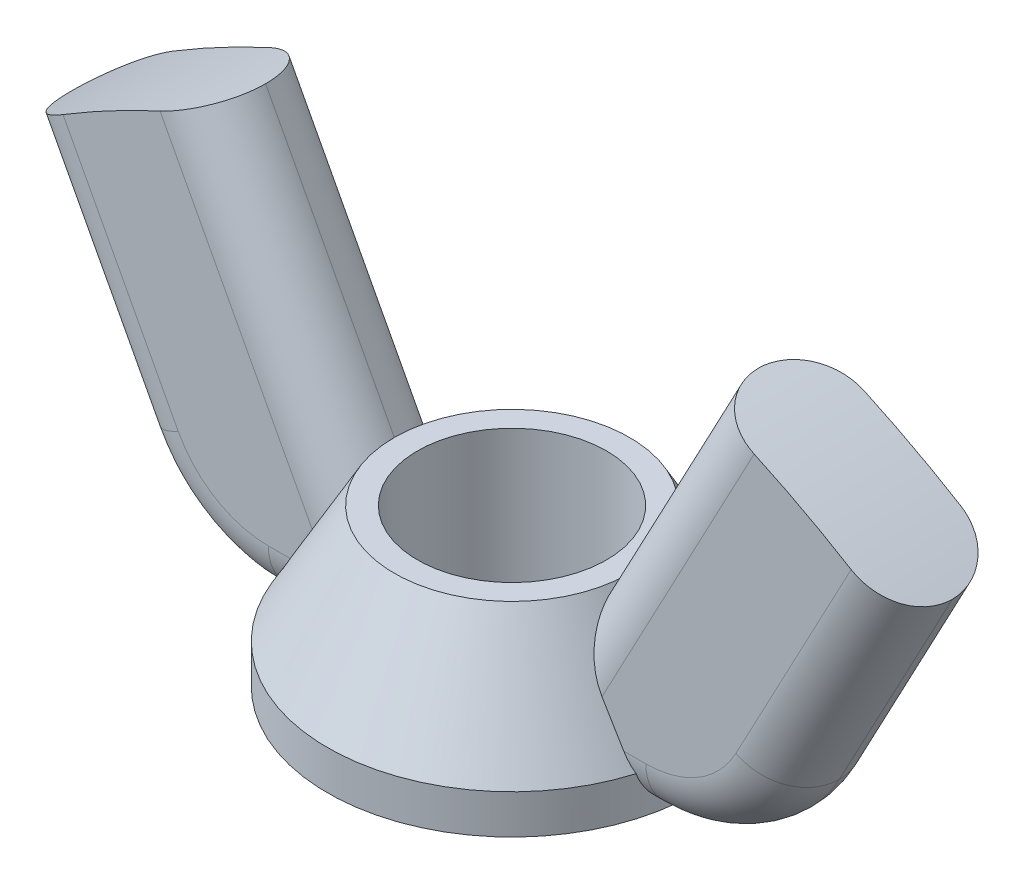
ISO-10303-21;
HEADER;
FILE_DESCRIPTION(('STEP AP214'),'2;1');
FILE_NAME('part.step','',(''),(''),'','','');
FILE_SCHEMA(('AUTOMOTIVE_DESIGN { 1 0 10303 214 1 1 1 1 }'));
ENDSEC;
DATA;
#1=APPLICATION_CONTEXT('core data for automotive mechanical design processes');
#2=APPLICATION_PROTOCOL_DEFINITION('international standard','automotive_design',2000,#1);
#3=PRODUCT_CONTEXT('',#1,'mechanical');
#4=PRODUCT('Part','Part','',(#3));
#5=PRODUCT_RELATED_PRODUCT_CATEGORY('part','',(#4));
#6=PRODUCT_DEFINITION_FORMATION('','',#4);
#7=PRODUCT_DEFINITION_CONTEXT('part definition',#1,'design');
#8=PRODUCT_DEFINITION('design','',#6,#7);
#9=PRODUCT_DEFINITION_SHAPE('','',#8);
#10=(LENGTH_UNIT() NAMED_UNIT(*) SI_UNIT(.MILLI.,.METRE.));
#11=(NAMED_UNIT(*) PLANE_ANGLE_UNIT() SI_UNIT($,.RADIAN.));
#12=(NAMED_UNIT(*) SI_UNIT($,.STERADIAN.) SOLID_ANGLE_UNIT());
#13=UNCERTAINTY_MEASURE_WITH_UNIT(LENGTH_MEASURE(1.E-05),#10,'distance_accuracy_value','');
#14=(GEOMETRIC_REPRESENTATION_CONTEXT(3) GLOBAL_UNCERTAINTY_ASSIGNED_CONTEXT((#13)) GLOBAL_UNIT_ASSIGNED_CONTEXT((#10,
#11,#12)) REPRESENTATION_CONTEXT('',''));
#15=CARTESIAN_POINT('',(0.,0.,0.));
#16=DIRECTION('',(0.,0.,1.));
#17=DIRECTION('',(1.,0.,0.));
#18=AXIS2_PLACEMENT_3D('',#15,#16,#17);
#19=CARTESIAN_POINT('',(0.,47.346393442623,0.));
#20=DIRECTION('',(0.,1.,0.));
#21=DIRECTION('',(0.,0.,1.));
#22=AXIS2_PLACEMENT_3D('',#19,#20,#21);
#23=CYLINDRICAL_SURFACE('',#22,4.7);
#24=CARTESIAN_POINT('',(0.,0.,0.));
#25=DIRECTION('',(0.,1.,0.));
#26=DIRECTION('',(0.,0.,1.));
#27=AXIS2_PLACEMENT_3D('',#24,#25,#26);
#28=CIRCLE('',#27,4.7);
#29=CARTESIAN_POINT('',(4.7,0.,0.));
#30=VERTEX_POINT('',#29);
#31=CARTESIAN_POINT('',(-4.7,0.,0.));
#32=VERTEX_POINT('',#31);
#33=EDGE_CURVE('E491',#30,#32,#28,.T.);
#34=ORIENTED_EDGE('',*,*,#33,.T.);
#35=CARTESIAN_POINT('',(-4.7,0.,0.));
#36=CARTESIAN_POINT('',(-4.70000257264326,-6.74090068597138E-07,-0.0384853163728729));
#37=CARTESIAN_POINT('',(-4.69952673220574,0.00158793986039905,-0.076951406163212));
#38=CARTESIAN_POINT('',(-4.69764568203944,0.00791938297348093,-0.153592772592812));
#39=CARTESIAN_POINT('',(-4.69624065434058,0.0126615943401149,-0.191768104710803));
#40=CARTESIAN_POINT('',(-4.69068451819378,0.0315427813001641,-0.305260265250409));
#41=CARTESIAN_POINT('',(-4.68519200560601,0.0503366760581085,-0.379791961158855));
#42=CARTESIAN_POINT('',(-4.67121295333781,0.0996984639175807,-0.524468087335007));
#43=CARTESIAN_POINT('',(-4.66272723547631,0.130263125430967,-0.594613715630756));
#44=CARTESIAN_POINT('',(-4.6436430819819,0.202242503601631,-0.728818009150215));
#45=CARTESIAN_POINT('',(-4.63304371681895,0.243661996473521,-0.792873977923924));
#46=CARTESIAN_POINT('',(-4.61053010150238,0.33740628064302,-0.914857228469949));
#47=CARTESIAN_POINT('',(-4.59858915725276,0.389982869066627,-0.972585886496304));
#48=CARTESIAN_POINT('',(-4.57490002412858,0.503999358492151,-1.07853484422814));
#49=CARTESIAN_POINT('',(-4.56315178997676,0.565437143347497,-1.1267574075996));
#50=CARTESIAN_POINT('',(-4.5425544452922,0.687320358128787,-1.20693946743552));
#51=CARTESIAN_POINT('',(-4.53352670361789,0.74688989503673,-1.24018957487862));
#52=CARTESIAN_POINT('',(-4.51736936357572,0.870435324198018,-1.29777818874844));
#53=CARTESIAN_POINT('',(-4.51024004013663,0.934411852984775,-1.32211540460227));
#54=CARTESIAN_POINT('',(-4.50444225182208,1.,-1.34164078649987));
#55=B_SPLINE_CURVE_WITH_KNOTS('',3,(#35,#36,#37,#38,#39,#40,#41,#42,#43,#44,#45,#46,#47,#48,#49,
#50,#51,#52,#53,#54),.UNSPECIFIED.,.F.,.F.,(4,2,2,2,2,2,2,2,2,4),(0.,0.115382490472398,
0.230742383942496,0.460725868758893,0.690646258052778,0.92066798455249,1.15657214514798,
1.39242006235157,1.59813844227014,1.80388659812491),.UNSPECIFIED.);
#56=CARTESIAN_POINT('',(-4.50444225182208,1.,-1.34164078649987));
#57=VERTEX_POINT('',#56);
#58=EDGE_CURVE('E336',#32,#57,#55,.T.);
#59=ORIENTED_EDGE('',*,*,#58,.T.);
#60=CARTESIAN_POINT('',(0.,1.,0.));
#61=DIRECTION('',(0.,1.,0.));
#62=DIRECTION('',(0.,0.,1.));
#63=AXIS2_PLACEMENT_3D('',#60,#61,#62);
#64=CIRCLE('',#63,4.7);
#65=CARTESIAN_POINT('',(4.50444225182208,1.,-1.34164078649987));
#66=VERTEX_POINT('',#65);
#67=EDGE_CURVE('E490',#66,#57,#64,.T.);
#68=ORIENTED_EDGE('',*,*,#67,.F.);
#69=CARTESIAN_POINT('',(4.50444225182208,1.,-1.34164078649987));
#70=CARTESIAN_POINT('',(4.50780537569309,0.962100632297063,-1.33034134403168));
#71=CARTESIAN_POINT('',(4.51160061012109,0.924737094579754,-1.31745219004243));
#72=CARTESIAN_POINT('',(4.51992625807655,0.851310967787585,-1.28860276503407));
#73=CARTESIAN_POINT('',(4.52445647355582,0.815248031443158,-1.27264332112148));
#74=CARTESIAN_POINT('',(4.53893925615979,0.709469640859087,-1.22038361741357));
#75=CARTESIAN_POINT('',(4.5497989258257,0.642006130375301,-1.17965438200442));
#76=CARTESIAN_POINT('',(4.57266217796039,0.515040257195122,-1.08765755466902));
#77=CARTESIAN_POINT('',(4.58466513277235,0.455533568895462,-1.03639572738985));
#78=CARTESIAN_POINT('',(4.60850595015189,0.34586828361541,-0.924625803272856));
#79=CARTESIAN_POINT('',(4.62034378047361,0.295711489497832,-0.864115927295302));
#80=CARTESIAN_POINT('',(4.6427510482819,0.205391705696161,-0.734344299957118));
#81=CARTESIAN_POINT('',(4.65329705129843,0.165402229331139,-0.664957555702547));
#82=CARTESIAN_POINT('',(4.67170324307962,0.0977433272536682,-0.520103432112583));
#83=CARTESIAN_POINT('',(4.67956517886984,0.0700658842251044,-0.444640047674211));
#84=CARTESIAN_POINT('',(4.69030449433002,0.0328108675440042,-0.307598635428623));
#85=CARTESIAN_POINT('',(4.69391092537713,0.0205403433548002,-0.246796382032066));
#86=CARTESIAN_POINT('',(4.69877257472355,0.00412124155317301,-0.124009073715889));
#87=CARTESIAN_POINT('',(4.70002755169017,-2.65024101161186E-05,-0.0620238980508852));
#88=CARTESIAN_POINT('',(4.7,0.,0.));
#89=B_SPLINE_CURVE_WITH_KNOTS('',3,(#69,#70,#71,#72,#73,#74,#75,#76,#77,#78,#79,#80,#81,#82,#83,
#84,#85,#86,#87,#88),.UNSPECIFIED.,.F.,.F.,(4,2,2,2,2,2,2,2,2,4),(0.,0.118991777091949,
0.237951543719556,0.475379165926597,0.712677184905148,0.95002091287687,1.19117793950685,
1.43217769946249,1.61801013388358,1.8038616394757),.UNSPECIFIED.);
#90=EDGE_CURVE('E354',#66,#30,#89,.T.);
#91=ORIENTED_EDGE('',*,*,#90,.T.);
#92=EDGE_LOOP('',(#34,#59,#68,#91));
#93=FACE_BOUND('',#92,.T.);
#94=ADVANCED_FACE('F31',(#93),#23,.T.);
#95=CARTESIAN_POINT('',(0.,1.,0.));
#96=DIRECTION('',(0.,-1.,0.));
#97=DIRECTION('',(0.,0.,-1.));
#98=AXIS2_PLACEMENT_3D('',#95,#96,#97);
#99=CONICAL_SURFACE('',#98,4.7,0.515549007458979);
#100=CARTESIAN_POINT('',(-0.894304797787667,6.36248432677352,-1.4));
#101=CARTESIAN_POINT('',(-0.928068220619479,6.33039199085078,-1.4));
#102=CARTESIAN_POINT('',(-0.961196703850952,6.29764890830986,-1.4));
#103=CARTESIAN_POINT('',(-1.02635085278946,6.23110305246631,-1.4));
#104=CARTESIAN_POINT('',(-1.05837689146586,6.19730064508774,-1.4));
#105=CARTESIAN_POINT('',(-1.15301437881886,6.09471044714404,-1.4));
#106=CARTESIAN_POINT('',(-1.21426055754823,6.02466624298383,-1.4));
#107=CARTESIAN_POINT('',(-1.33392729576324,5.88251720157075,-1.4));
#108=CARTESIAN_POINT('',(-1.39235425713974,5.81041768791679,-1.4));
#109=CARTESIAN_POINT('',(-1.50721125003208,5.66461235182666,-1.4));
#110=CARTESIAN_POINT('',(-1.56364060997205,5.59090600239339,-1.4));
#111=CARTESIAN_POINT('',(-1.6747611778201,5.4425646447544,-1.4));
#112=CARTESIAN_POINT('',(-1.72945733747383,5.36793333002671,-1.4));
#113=CARTESIAN_POINT('',(-1.83761274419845,5.21779585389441,-1.4));
#114=CARTESIAN_POINT('',(-1.89107213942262,5.14228979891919,-1.4));
#115=CARTESIAN_POINT('',(-2.05006087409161,4.91462985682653,-1.4));
#116=CARTESIAN_POINT('',(-2.1541168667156,4.76144794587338,-1.4));
#117=CARTESIAN_POINT('',(-2.34484733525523,4.47540954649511,-1.4));
#118=CARTESIAN_POINT('',(-2.43187532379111,4.34278690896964,-1.4));
#119=CARTESIAN_POINT('',(-2.60446388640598,4.07659006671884,-1.4));
#120=CARTESIAN_POINT('',(-2.69002445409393,3.94301585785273,-1.4));
#121=CARTESIAN_POINT('',(-2.9449971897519,3.54131249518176,-1.4));
#122=CARTESIAN_POINT('',(-3.112747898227,3.27213042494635,-1.4));
#123=CARTESIAN_POINT('',(-3.44588371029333,2.7314319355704,-1.4));
#124=CARTESIAN_POINT('',(-3.61126224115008,2.45991148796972,-1.4));
#125=CARTESIAN_POINT('',(-3.94015112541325,1.91571920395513,-1.4));
#126=CARTESIAN_POINT('',(-4.10366135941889,1.64304729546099,-1.4));
#127=CARTESIAN_POINT('',(-4.52384912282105,0.938513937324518,-1.4));
#128=CARTESIAN_POINT('',(-4.77954686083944,0.506068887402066,-1.4));
#129=CARTESIAN_POINT('',(-5.28892587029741,-0.359993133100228,-1.4));
#130=CARTESIAN_POINT('',(-5.5426071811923,-0.793610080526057,-1.4));
#131=CARTESIAN_POINT('',(-6.0475365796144,-1.65974215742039,-1.4));
#132=CARTESIAN_POINT('',(-6.29879044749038,-2.09225391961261,-1.4));
#133=CARTESIAN_POINT('',(-6.80034548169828,-2.95783415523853,-1.4));
#134=CARTESIAN_POINT('',(-7.0506466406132,-3.39090263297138,-1.4));
#135=CARTESIAN_POINT('',(-7.30065580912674,-3.82413843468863,-1.4));
#136=B_SPLINE_CURVE_WITH_KNOTS('',3,(#100,#101,#102,#103,#104,#105,#106,#107,#108,#109,#110,
#111,#112,#113,#114,#115,#116,#117,#118,#119,#120,#121,#122,#123,#124,#125,#126,#127,#128,#129,
#130,#131,#132,#133,#134,#135),.UNSPECIFIED.,.F.,.F.,(4,2,2,2,2,2,2,2,2,2,2,2,2,2,2,2,2,4),(0.,
0.139719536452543,0.279391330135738,0.558419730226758,0.836781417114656,1.11523581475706,
1.39280572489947,1.67034221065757,2.22583906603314,2.70171178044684,3.17758656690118,
4.12907694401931,5.08282957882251,6.03664282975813,7.54378614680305,9.05089990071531,
10.5514831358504,12.0520780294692),.UNSPECIFIED.);
#137=CARTESIAN_POINT('',(-3.693909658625,2.32297800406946,-1.4));
#138=VERTEX_POINT('',#137);
#139=CARTESIAN_POINT('',(-4.24861284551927,1.39999999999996,-1.4));
#140=VERTEX_POINT('',#139);
#141=EDGE_CURVE('E254',#138,#140,#136,.T.);
#142=ORIENTED_EDGE('',*,*,#141,.F.);
#143=CARTESIAN_POINT('',(-3.69390965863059,2.32297800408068,-1.4));
#144=CARTESIAN_POINT('',(-3.66292595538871,2.37408544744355,-1.39999788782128));
#145=CARTESIAN_POINT('',(-3.63272198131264,2.42563278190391,-1.39717563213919));
#146=CARTESIAN_POINT('',(-3.57410333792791,2.52912875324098,-1.38618689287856));
#147=CARTESIAN_POINT('',(-3.54568740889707,2.58107707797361,-1.37802421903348));
#148=CARTESIAN_POINT('',(-3.49084839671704,2.68493571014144,-1.3566570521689));
#149=CARTESIAN_POINT('',(-3.46442398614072,2.73684601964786,-1.34345595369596));
#150=CARTESIAN_POINT('',(-3.41366145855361,2.84023724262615,-1.31226718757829));
#151=CARTESIAN_POINT('',(-3.38932360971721,2.89171810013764,-1.29427890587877));
#152=CARTESIAN_POINT('',(-3.32321030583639,3.03685179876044,-1.23664113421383));
#153=CARTESIAN_POINT('',(-3.28398853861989,3.12955036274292,-1.1914991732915));
#154=CARTESIAN_POINT('',(-3.21295366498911,3.30923043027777,-1.08637496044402));
#155=CARTESIAN_POINT('',(-3.18114005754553,3.39621232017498,-1.026393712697));
#156=CARTESIAN_POINT('',(-3.13158547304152,3.54085664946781,-0.907621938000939));
#157=CARTESIAN_POINT('',(-3.11229802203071,3.60056164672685,-0.851964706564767));
#158=CARTESIAN_POINT('',(-3.07803690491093,3.71171219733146,-0.731754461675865));
#159=CARTESIAN_POINT('',(-3.06305583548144,3.7631718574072,-0.667217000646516));
#160=CARTESIAN_POINT('',(-3.04086284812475,3.84240893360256,-0.547060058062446));
#161=CARTESIAN_POINT('',(-3.03264375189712,3.87287417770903,-0.493408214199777));
#162=CARTESIAN_POINT('',(-3.01885520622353,3.92513598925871,-0.381801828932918));
#163=CARTESIAN_POINT('',(-3.01327774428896,3.94695873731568,-0.323860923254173));
#164=CARTESIAN_POINT('',(-3.00610314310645,3.97536651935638,-0.221538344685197));
#165=CARTESIAN_POINT('',(-3.00382842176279,3.98450849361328,-0.177910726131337));
#166=CARTESIAN_POINT('',(-3.00077047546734,3.99686948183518,-0.0895471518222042));
#167=CARTESIAN_POINT('',(-2.99999514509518,4.00005714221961,-0.0448065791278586));
#168=CARTESIAN_POINT('',(-3.,4.,0.));
#169=B_SPLINE_CURVE_WITH_KNOTS('',3,(#143,#144,#145,#146,#147,#148,#149,#150,#151,#152,#153,
#154,#155,#156,#157,#158,#159,#160,#161,#162,#163,#164,#165,#166,#167,#168),.UNSPECIFIED.,.F.,
.F.,(4,2,2,2,2,2,2,2,2,2,2,2,4),(0.,0.179183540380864,0.358239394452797,0.537174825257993,
0.71613321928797,1.04563381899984,1.37511212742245,1.62594483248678,1.87634370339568,
2.06242183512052,2.24793188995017,2.38141994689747,2.5156089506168),.UNSPECIFIED.);
#170=CARTESIAN_POINT('',(-3.,4.,0.));
#171=VERTEX_POINT('',#170);
#172=EDGE_CURVE('E407',#138,#171,#169,.T.);
#173=ORIENTED_EDGE('',*,*,#172,.T.);
#174=CARTESIAN_POINT('',(0.,4.,0.));
#175=DIRECTION('',(0.,1.,0.));
#176=DIRECTION('',(0.,0.,1.));
#177=AXIS2_PLACEMENT_3D('',#174,#175,#176);
#178=CIRCLE('',#177,3.);
#179=CARTESIAN_POINT('',(3.,4.,0.));
#180=VERTEX_POINT('',#179);
#181=EDGE_CURVE('E51',#180,#171,#178,.T.);
#182=ORIENTED_EDGE('',*,*,#181,.F.);
#183=CARTESIAN_POINT('',(3.,4.,0.));
#184=CARTESIAN_POINT('',(2.99999840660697,4.00001628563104,-0.0313009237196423));
#185=CARTESIAN_POINT('',(3.00037611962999,3.99847217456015,-0.0625922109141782));
#186=CARTESIAN_POINT('',(3.00187691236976,3.99238956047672,-0.124826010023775));
#187=CARTESIAN_POINT('',(3.00299905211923,3.9878548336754,-0.155768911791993));
#188=CARTESIAN_POINT('',(3.00595850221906,3.97598502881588,-0.216706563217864));
#189=CARTESIAN_POINT('',(3.00778749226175,3.9686825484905,-0.246708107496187));
#190=CARTESIAN_POINT('',(3.01213990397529,3.95148512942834,-0.305904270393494));
#191=CARTESIAN_POINT('',(3.01466350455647,3.94158952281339,-0.335098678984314));
#192=CARTESIAN_POINT('',(3.02321510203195,3.90847906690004,-0.42090622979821));
#193=CARTESIAN_POINT('',(3.03024143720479,3.88176689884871,-0.476098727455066));
#194=CARTESIAN_POINT('',(3.04680621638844,3.82094110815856,-0.58194573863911));
#195=CARTESIAN_POINT('',(3.05635319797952,3.78680240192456,-0.632584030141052));
#196=CARTESIAN_POINT('',(3.08349937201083,3.69346455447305,-0.754391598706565));
#197=CARTESIAN_POINT('',(3.10269244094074,3.63052988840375,-0.822347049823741));
#198=CARTESIAN_POINT('',(3.14648909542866,3.49616073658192,-0.947154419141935));
#199=CARTESIAN_POINT('',(3.17110185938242,3.42471192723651,-1.00398718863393));
#200=CARTESIAN_POINT('',(3.22658273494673,3.27403247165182,-1.10833326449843));
#201=CARTESIAN_POINT('',(3.25761875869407,3.19463093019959,-1.15550940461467));
#202=CARTESIAN_POINT('',(3.32541131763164,3.03241268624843,-1.23806342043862));
#203=CARTESIAN_POINT('',(3.36216008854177,2.94960072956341,-1.27345710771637));
#204=CARTESIAN_POINT('',(3.44429409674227,2.77598638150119,-1.33408669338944));
#205=CARTESIAN_POINT('',(3.490119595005,2.68504945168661,-1.35836542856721));
#206=CARTESIAN_POINT('',(3.56331813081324,2.54883796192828,-1.38308468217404));
#207=CARTESIAN_POINT('',(3.5885078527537,2.50338904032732,-1.38937530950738));
#208=CARTESIAN_POINT('',(3.64023461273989,2.41284571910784,-1.3978323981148));
#209=CARTESIAN_POINT('',(3.66677236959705,2.36775152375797,-1.39999663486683));
#210=CARTESIAN_POINT('',(3.6939096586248,2.32297800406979,-1.4));
#211=B_SPLINE_CURVE_WITH_KNOTS('',3,(#183,#184,#185,#186,#187,#188,#189,#190,#191,#192,#193,
#194,#195,#196,#197,#198,#199,#200,#201,#202,#203,#204,#205,#206,#207,#208,#209,#210),
.UNSPECIFIED.,.F.,.F.,(4,2,2,2,2,2,2,2,2,2,2,2,2,4),(0.,0.093846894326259,0.187575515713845,
0.280232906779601,0.372914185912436,0.557202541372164,0.742123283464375,1.02432772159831,
1.30701380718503,1.59832301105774,1.8892396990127,2.20190436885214,2.35877313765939,
2.51572644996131),.UNSPECIFIED.);
#212=CARTESIAN_POINT('',(3.69390965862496,2.32297800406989,-1.4));
#213=VERTEX_POINT('',#212);
#214=EDGE_CURVE('E44',#180,#213,#211,.T.);
#215=ORIENTED_EDGE('',*,*,#214,.T.);
#216=CARTESIAN_POINT('',(1.37205780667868,5.83486979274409,-1.4));
#217=CARTESIAN_POINT('',(1.40663993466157,5.79214568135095,-1.4));
#218=CARTESIAN_POINT('',(1.44082600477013,5.74910470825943,-1.4));
#219=CARTESIAN_POINT('',(1.5085078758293,5.66248803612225,-1.4));
#220=CARTESIAN_POINT('',(1.54200372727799,5.61891237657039,-1.4));
#221=CARTESIAN_POINT('',(1.64159813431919,5.48754620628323,-1.4));
#222=CARTESIAN_POINT('',(1.70682226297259,5.39909313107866,-1.4));
#223=CARTESIAN_POINT('',(1.8354732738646,5.2209806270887,-1.4));
#224=CARTESIAN_POINT('',(1.89890125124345,5.13132198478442,-1.4));
#225=CARTESIAN_POINT('',(2.02439968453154,4.95105105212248,-1.4));
#226=CARTESIAN_POINT('',(2.08647003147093,4.86043868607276,-1.4));
#227=CARTESIAN_POINT('',(2.27095870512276,4.58770579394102,-1.4));
#228=CARTESIAN_POINT('',(2.39178326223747,4.4045086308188,-1.4));
#229=CARTESIAN_POINT('',(2.63066422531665,4.03628747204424,-1.4));
#230=CARTESIAN_POINT('',(2.7487201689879,3.85126317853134,-1.4));
#231=CARTESIAN_POINT('',(2.93717315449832,3.5524435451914,-1.4));
#232=CARTESIAN_POINT('',(3.00818592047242,3.43903568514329,-1.4));
#233=CARTESIAN_POINT('',(3.1496070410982,3.21185268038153,-1.4));
#234=CARTESIAN_POINT('',(3.22001542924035,3.09807755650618,-1.4));
#235=CARTESIAN_POINT('',(3.43054316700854,2.75622229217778,-1.4));
#236=CARTESIAN_POINT('',(3.56991955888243,2.52768477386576,-1.4));
#237=CARTESIAN_POINT('',(3.93800210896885,1.91999940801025,-1.4));
#238=CARTESIAN_POINT('',(4.16550304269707,1.54012290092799,-1.4));
#239=CARTESIAN_POINT('',(4.61818134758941,0.778987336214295,-1.4));
#240=CARTESIAN_POINT('',(4.84335869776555,0.397728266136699,-1.4));
#241=CARTESIAN_POINT('',(5.29193547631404,-0.365288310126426,-1.4));
#242=CARTESIAN_POINT('',(5.51533653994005,-0.747044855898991,-1.4));
#243=CARTESIAN_POINT('',(5.96102890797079,-1.51119005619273,-1.4));
#244=CARTESIAN_POINT('',(6.18332024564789,-1.89357869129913,-1.4));
#245=CARTESIAN_POINT('',(6.40527663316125,-2.27615984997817,-1.4));
#246=B_SPLINE_CURVE_WITH_KNOTS('',3,(#216,#217,#218,#219,#220,#221,#222,#223,#224,#225,#226,
#227,#228,#229,#230,#231,#232,#233,#234,#235,#236,#237,#238,#239,#240,#241,#242,#243,#244,#245),
.UNSPECIFIED.,.F.,.F.,(4,2,2,2,2,2,2,2,2,2,2,2,2,2,4),(0.,0.164891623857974,0.3297711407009,
0.659440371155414,0.988904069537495,1.31839411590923,1.97670869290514,2.63513242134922,
3.03654968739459,3.4379445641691,4.24099117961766,5.56934581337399,6.89771243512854,
8.22466724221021,9.55158202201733),.UNSPECIFIED.);
#247=CARTESIAN_POINT('',(4.24861284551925,1.39999999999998,-1.4));
#248=VERTEX_POINT('',#247);
#249=EDGE_CURVE('E493',#213,#248,#246,.T.);
#250=ORIENTED_EDGE('',*,*,#249,.T.);
#251=CARTESIAN_POINT('',(4.24861284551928,1.4,-1.4));
#252=CARTESIAN_POINT('',(4.26913210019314,1.36560706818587,-1.39999853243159));
#253=CARTESIAN_POINT('',(4.28994734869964,1.33139667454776,-1.39873275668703));
#254=CARTESIAN_POINT('',(4.33196056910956,1.26357307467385,-1.39375047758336));
#255=CARTESIAN_POINT('',(4.35315676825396,1.2299580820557,-1.39004338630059));
#256=CARTESIAN_POINT('',(4.3958810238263,1.16329355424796,-1.3802554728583));
#257=CARTESIAN_POINT('',(4.41740906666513,1.13024399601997,-1.37417474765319));
#258=CARTESIAN_POINT('',(4.46075737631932,1.06467045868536,-1.35966348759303));
#259=CARTESIAN_POINT('',(4.48257844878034,1.03214899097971,-1.35122400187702));
#260=CARTESIAN_POINT('',(4.50444225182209,1.,-1.34164078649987));
#261=B_SPLINE_CURVE_WITH_KNOTS('',3,(#251,#252,#253,#254,#255,#256,#257,#258,#259,#260),
.UNSPECIFIED.,.F.,.F.,(4,2,2,2,4),(0.,0.1201179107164,0.239775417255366,0.359428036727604,
0.479541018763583),.UNSPECIFIED.);
#262=EDGE_CURVE('E347',#248,#66,#261,.T.);
#263=ORIENTED_EDGE('',*,*,#262,.T.);
#264=ORIENTED_EDGE('',*,*,#67,.T.);
#265=CARTESIAN_POINT('',(-4.50444225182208,1.,-1.34164078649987));
#266=CARTESIAN_POINT('',(-4.48257844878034,1.03214899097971,-1.35122400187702));
#267=CARTESIAN_POINT('',(-4.46075737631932,1.06467045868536,-1.35966348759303));
#268=CARTESIAN_POINT('',(-4.41740906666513,1.13024399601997,-1.37417474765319));
#269=CARTESIAN_POINT('',(-4.3958810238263,1.16329355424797,-1.3802554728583));
#270=CARTESIAN_POINT('',(-4.35315676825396,1.2299580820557,-1.39004338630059));
#271=CARTESIAN_POINT('',(-4.33196056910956,1.26357307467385,-1.39375047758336));
#272=CARTESIAN_POINT('',(-4.28994734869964,1.33139667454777,-1.39873275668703));
#273=CARTESIAN_POINT('',(-4.26913210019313,1.36560706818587,-1.39999853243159));
#274=CARTESIAN_POINT('',(-4.24861284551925,1.39999999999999,-1.4));
#275=B_SPLINE_CURVE_WITH_KNOTS('',3,(#265,#266,#267,#268,#269,#270,#271,#272,#273,#274),
.UNSPECIFIED.,.F.,.F.,(4,2,2,2,4),(0.,0.12011298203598,0.239765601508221,0.359423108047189,
0.47954101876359),.UNSPECIFIED.);
#276=EDGE_CURVE('E342',#57,#140,#275,.T.);
#277=ORIENTED_EDGE('',*,*,#276,.T.);
#278=EDGE_LOOP('',(#142,#173,#182,#215,#250,#263,#264,#277));
#279=FACE_BOUND('',#278,.T.);
#280=ADVANCED_FACE('F561',(#279),#99,.T.);
#281=CARTESIAN_POINT('',(-4.50444225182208,1.,1.34164078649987));
#282=VERTEX_POINT('',#281);
#283=CARTESIAN_POINT('',(4.50444225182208,1.,1.34164078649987));
#284=VERTEX_POINT('',#283);
#285=EDGE_CURVE('E478',#282,#284,#64,.T.);
#286=ORIENTED_EDGE('',*,*,#285,.F.);
#287=CARTESIAN_POINT('',(-4.50444225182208,1.,1.34164078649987));
#288=CARTESIAN_POINT('',(-4.5078053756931,0.962100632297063,1.33034134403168));
#289=CARTESIAN_POINT('',(-4.51160061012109,0.924737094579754,1.31745219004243));
#290=CARTESIAN_POINT('',(-4.51992625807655,0.851310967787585,1.28860276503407));
#291=CARTESIAN_POINT('',(-4.52445647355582,0.815248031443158,1.27264332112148));
#292=CARTESIAN_POINT('',(-4.53893925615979,0.709469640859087,1.22038361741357));
#293=CARTESIAN_POINT('',(-4.5497989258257,0.642006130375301,1.17965438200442));
#294=CARTESIAN_POINT('',(-4.57266217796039,0.515040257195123,1.08765755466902));
#295=CARTESIAN_POINT('',(-4.58466513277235,0.455533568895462,1.03639572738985));
#296=CARTESIAN_POINT('',(-4.60850595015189,0.34586828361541,0.924625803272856));
#297=CARTESIAN_POINT('',(-4.62034378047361,0.295711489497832,0.864115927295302));
#298=CARTESIAN_POINT('',(-4.6427510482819,0.205391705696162,0.734344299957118));
#299=CARTESIAN_POINT('',(-4.65329705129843,0.165402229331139,0.664957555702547));
#300=CARTESIAN_POINT('',(-4.67170324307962,0.0977433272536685,0.520103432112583));
#301=CARTESIAN_POINT('',(-4.67956517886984,0.0700658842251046,0.444640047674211));
#302=CARTESIAN_POINT('',(-4.69030449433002,0.0328108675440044,0.307598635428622));
#303=CARTESIAN_POINT('',(-4.69391092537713,0.0205403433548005,0.246796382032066));
#304=CARTESIAN_POINT('',(-4.69877257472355,0.00412124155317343,0.124009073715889));
#305=CARTESIAN_POINT('',(-4.70002755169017,-2.65024101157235E-05,0.0620238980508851));
#306=CARTESIAN_POINT('',(-4.7,0.,0.));
#307=B_SPLINE_CURVE_WITH_KNOTS('',3,(#287,#288,#289,#290,#291,#292,#293,#294,#295,#296,#297,
#298,#299,#300,#301,#302,#303,#304,#305,#306),.UNSPECIFIED.,.F.,.F.,(4,2,2,2,2,2,2,2,2,4),(0.,
0.118991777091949,0.237951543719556,0.475379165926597,0.712677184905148,0.95002091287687,
1.19117793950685,1.43217769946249,1.61801013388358,1.8038616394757),.UNSPECIFIED.);
#308=EDGE_CURVE('E390',#282,#32,#307,.T.);
#309=ORIENTED_EDGE('',*,*,#308,.T.);
#310=EDGE_CURVE('E476',#32,#30,#28,.T.);
#311=ORIENTED_EDGE('',*,*,#310,.T.);
#312=CARTESIAN_POINT('',(4.7,0.,0.));
#313=CARTESIAN_POINT('',(4.70000257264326,-6.74090068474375E-07,0.0384853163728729));
#314=CARTESIAN_POINT('',(4.69952673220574,0.00158793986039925,0.0769514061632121));
#315=CARTESIAN_POINT('',(4.69764568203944,0.00791938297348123,0.153592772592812));
#316=CARTESIAN_POINT('',(4.69624065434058,0.0126615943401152,0.191768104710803));
#317=CARTESIAN_POINT('',(4.69068451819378,0.0315427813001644,0.305260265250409));
#318=CARTESIAN_POINT('',(4.68519200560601,0.0503366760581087,0.379791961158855));
#319=CARTESIAN_POINT('',(4.67121295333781,0.099698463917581,0.524468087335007));
#320=CARTESIAN_POINT('',(4.66272723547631,0.130263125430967,0.594613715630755));
#321=CARTESIAN_POINT('',(4.6436430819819,0.202242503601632,0.728818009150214));
#322=CARTESIAN_POINT('',(4.63304371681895,0.243661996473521,0.792873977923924));
#323=CARTESIAN_POINT('',(4.61053010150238,0.33740628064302,0.914857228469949));
#324=CARTESIAN_POINT('',(4.59858915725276,0.389982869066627,0.972585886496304));
#325=CARTESIAN_POINT('',(4.57490002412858,0.503999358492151,1.07853484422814));
#326=CARTESIAN_POINT('',(4.56315178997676,0.565437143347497,1.1267574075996));
#327=CARTESIAN_POINT('',(4.5425544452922,0.687320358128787,1.20693946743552));
#328=CARTESIAN_POINT('',(4.53352670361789,0.74688989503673,1.24018957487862));
#329=CARTESIAN_POINT('',(4.51736936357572,0.870435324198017,1.29777818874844));
#330=CARTESIAN_POINT('',(4.51024004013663,0.934411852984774,1.32211540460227));
#331=CARTESIAN_POINT('',(4.50444225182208,1.,1.34164078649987));
#332=B_SPLINE_CURVE_WITH_KNOTS('',3,(#312,#313,#314,#315,#316,#317,#318,#319,#320,#321,#322,
#323,#324,#325,#326,#327,#328,#329,#330,#331),.UNSPECIFIED.,.F.,.F.,(4,2,2,2,2,2,2,2,2,4),(0.,
0.115382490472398,0.230742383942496,0.460725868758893,0.690646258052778,0.92066798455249,
1.15657214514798,1.39242006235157,1.59813844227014,1.80388659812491),.UNSPECIFIED.);
#333=EDGE_CURVE('E200',#30,#284,#332,.T.);
#334=ORIENTED_EDGE('',*,*,#333,.T.);
#335=EDGE_LOOP('',(#286,#309,#311,#334));
#336=FACE_BOUND('',#335,.T.);
#337=ADVANCED_FACE('F475',(#336),#23,.T.);
#338=EDGE_CURVE('E57',#171,#180,#178,.T.);
#339=ORIENTED_EDGE('',*,*,#338,.F.);
#340=CARTESIAN_POINT('',(-3.,4.,0.));
#341=CARTESIAN_POINT('',(-2.99999840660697,4.00001628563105,0.0313009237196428));
#342=CARTESIAN_POINT('',(-3.00037611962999,3.99847217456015,0.0625922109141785));
#343=CARTESIAN_POINT('',(-3.00187691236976,3.99238956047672,0.124826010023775));
#344=CARTESIAN_POINT('',(-3.00299905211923,3.9878548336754,0.155768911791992));
#345=CARTESIAN_POINT('',(-3.00595850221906,3.97598502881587,0.216706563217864));
#346=CARTESIAN_POINT('',(-3.00778749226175,3.9686825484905,0.246708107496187));
#347=CARTESIAN_POINT('',(-3.01213990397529,3.95148512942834,0.305904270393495));
#348=CARTESIAN_POINT('',(-3.01466350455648,3.94158952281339,0.335098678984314));
#349=CARTESIAN_POINT('',(-3.02321510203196,3.90847906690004,0.420906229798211));
#350=CARTESIAN_POINT('',(-3.03024143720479,3.88176689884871,0.476098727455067));
#351=CARTESIAN_POINT('',(-3.04680621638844,3.82094110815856,0.581945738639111));
#352=CARTESIAN_POINT('',(-3.05635319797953,3.78680240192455,0.632584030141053));
#353=CARTESIAN_POINT('',(-3.08349937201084,3.69346455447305,0.754391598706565));
#354=CARTESIAN_POINT('',(-3.10269244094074,3.63052988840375,0.822347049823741));
#355=CARTESIAN_POINT('',(-3.14648909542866,3.49616073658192,0.947154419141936));
#356=CARTESIAN_POINT('',(-3.17110185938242,3.42471192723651,1.00398718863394));
#357=CARTESIAN_POINT('',(-3.22658273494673,3.27403247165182,1.10833326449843));
#358=CARTESIAN_POINT('',(-3.25761875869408,3.19463093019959,1.15550940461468));
#359=CARTESIAN_POINT('',(-3.32541131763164,3.03241268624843,1.23806342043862));
#360=CARTESIAN_POINT('',(-3.36216008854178,2.9496007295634,1.27345710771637));
#361=CARTESIAN_POINT('',(-3.44429409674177,2.77598638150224,1.33408669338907));
#362=CARTESIAN_POINT('',(-3.49011959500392,2.68504945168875,1.35836542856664));
#363=CARTESIAN_POINT('',(-3.5633181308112,2.54883796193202,1.38308468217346));
#364=CARTESIAN_POINT('',(-3.58850785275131,2.5033890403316,1.38937530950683));
#365=CARTESIAN_POINT('',(-3.64023461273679,2.41284571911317,1.39783239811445));
#366=CARTESIAN_POINT('',(-3.66677236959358,2.36775152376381,1.39999663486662));
#367=CARTESIAN_POINT('',(-3.69390965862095,2.32297800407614,1.4));
#368=B_SPLINE_CURVE_WITH_KNOTS('',3,(#340,#341,#342,#343,#344,#345,#346,#347,#348,#349,#350,
#351,#352,#353,#354,#355,#356,#357,#358,#359,#360,#361,#362,#363,#364,#365,#366,#367),
.UNSPECIFIED.,.F.,.F.,(4,2,2,2,2,2,2,2,2,2,2,2,2,4),(0.,0.0938468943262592,0.187575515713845,
0.280232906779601,0.372914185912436,0.557202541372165,0.742123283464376,1.02432772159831,
1.30701380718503,1.59832301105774,1.8892396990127,2.20190436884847,2.35877313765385,
2.5157264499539),.UNSPECIFIED.);
#369=CARTESIAN_POINT('',(-3.69390965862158,2.32297800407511,1.4));
#370=VERTEX_POINT('',#369);
#371=EDGE_CURVE('E464',#171,#370,#368,.T.);
#372=ORIENTED_EDGE('',*,*,#371,.T.);
#373=CARTESIAN_POINT('',(-0.894304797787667,6.36248432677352,1.4));
#374=CARTESIAN_POINT('',(-0.928068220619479,6.33039199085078,1.4));
#375=CARTESIAN_POINT('',(-0.961196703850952,6.29764890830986,1.4));
#376=CARTESIAN_POINT('',(-1.02635085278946,6.23110305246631,1.4));
#377=CARTESIAN_POINT('',(-1.05837689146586,6.19730064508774,1.4));
#378=CARTESIAN_POINT('',(-1.15301437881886,6.09471044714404,1.4));
#379=CARTESIAN_POINT('',(-1.21426055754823,6.02466624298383,1.4));
#380=CARTESIAN_POINT('',(-1.33392729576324,5.88251720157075,1.4));
#381=CARTESIAN_POINT('',(-1.39235425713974,5.81041768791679,1.4));
#382=CARTESIAN_POINT('',(-1.50721125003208,5.66461235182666,1.4));
#383=CARTESIAN_POINT('',(-1.56364060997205,5.59090600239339,1.4));
#384=CARTESIAN_POINT('',(-1.6747611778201,5.4425646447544,1.4));
#385=CARTESIAN_POINT('',(-1.72945733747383,5.36793333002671,1.4));
#386=CARTESIAN_POINT('',(-1.83761274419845,5.21779585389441,1.4));
#387=CARTESIAN_POINT('',(-1.89107213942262,5.14228979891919,1.4));
#388=CARTESIAN_POINT('',(-2.05006087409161,4.91462985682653,1.4));
#389=CARTESIAN_POINT('',(-2.1541168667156,4.76144794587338,1.4));
#390=CARTESIAN_POINT('',(-2.34484733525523,4.47540954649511,1.4));
#391=CARTESIAN_POINT('',(-2.43187532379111,4.34278690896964,1.4));
#392=CARTESIAN_POINT('',(-2.60446388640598,4.07659006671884,1.4));
#393=CARTESIAN_POINT('',(-2.69002445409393,3.94301585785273,1.4));
#394=CARTESIAN_POINT('',(-2.9449971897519,3.54131249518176,1.4));
#395=CARTESIAN_POINT('',(-3.112747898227,3.27213042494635,1.4));
#396=CARTESIAN_POINT('',(-3.44588371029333,2.7314319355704,1.4));
#397=CARTESIAN_POINT('',(-3.61126224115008,2.45991148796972,1.4));
#398=CARTESIAN_POINT('',(-3.94015112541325,1.91571920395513,1.4));
#399=CARTESIAN_POINT('',(-4.10366135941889,1.64304729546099,1.4));
#400=CARTESIAN_POINT('',(-4.52384912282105,0.938513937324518,1.4));
#401=CARTESIAN_POINT('',(-4.77954686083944,0.506068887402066,1.4));
#402=CARTESIAN_POINT('',(-5.28892587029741,-0.359993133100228,1.4));
#403=CARTESIAN_POINT('',(-5.5426071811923,-0.793610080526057,1.4));
#404=CARTESIAN_POINT('',(-6.0475365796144,-1.65974215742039,1.4));
#405=CARTESIAN_POINT('',(-6.29879044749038,-2.09225391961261,1.4));
#406=CARTESIAN_POINT('',(-6.80034548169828,-2.95783415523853,1.4));
#407=CARTESIAN_POINT('',(-7.0506466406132,-3.39090263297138,1.4));
#408=CARTESIAN_POINT('',(-7.30065580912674,-3.82413843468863,1.4));
#409=B_SPLINE_CURVE_WITH_KNOTS('',3,(#373,#374,#375,#376,#377,#378,#379,#380,#381,#382,#383,
#384,#385,#386,#387,#388,#389,#390,#391,#392,#393,#394,#395,#396,#397,#398,#399,#400,#401,#402,
#403,#404,#405,#406,#407,#408),.UNSPECIFIED.,.F.,.F.,(4,2,2,2,2,2,2,2,2,2,2,2,2,2,2,2,2,4),(0.,
0.139719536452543,0.279391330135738,0.558419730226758,0.836781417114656,1.11523581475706,
1.39280572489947,1.67034221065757,2.22583906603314,2.70171178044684,3.17758656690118,
4.12907694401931,5.08282957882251,6.03664282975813,7.54378614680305,9.05089990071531,
10.5514831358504,12.0520780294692),.UNSPECIFIED.);
#410=CARTESIAN_POINT('',(-4.24861284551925,1.39999999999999,1.4));
#411=VERTEX_POINT('',#410);
#412=EDGE_CURVE('E261',#370,#411,#409,.T.);
#413=ORIENTED_EDGE('',*,*,#412,.T.);
#414=CARTESIAN_POINT('',(-4.24861284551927,1.4,1.4));
#415=CARTESIAN_POINT('',(-4.26913210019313,1.36560706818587,1.39999853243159));
#416=CARTESIAN_POINT('',(-4.28994734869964,1.33139667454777,1.39873275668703));
#417=CARTESIAN_POINT('',(-4.33196056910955,1.26357307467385,1.39375047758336));
#418=CARTESIAN_POINT('',(-4.35315676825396,1.2299580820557,1.39004338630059));
#419=CARTESIAN_POINT('',(-4.3958810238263,1.16329355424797,1.3802554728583));
#420=CARTESIAN_POINT('',(-4.41740906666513,1.13024399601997,1.37417474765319));
#421=CARTESIAN_POINT('',(-4.46075737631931,1.06467045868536,1.35966348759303));
#422=CARTESIAN_POINT('',(-4.48257844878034,1.03214899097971,1.35122400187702));
#423=CARTESIAN_POINT('',(-4.50444225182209,1.,1.34164078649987));
#424=B_SPLINE_CURVE_WITH_KNOTS('',3,(#414,#415,#416,#417,#418,#419,#420,#421,#422,#423),
.UNSPECIFIED.,.F.,.F.,(4,2,2,2,4),(0.,0.120117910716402,0.23977541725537,0.359428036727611,
0.479541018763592),.UNSPECIFIED.);
#425=EDGE_CURVE('E384',#411,#282,#424,.T.);
#426=ORIENTED_EDGE('',*,*,#425,.T.);
#427=ORIENTED_EDGE('',*,*,#285,.T.);
#428=CARTESIAN_POINT('',(4.50444225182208,1.,1.34164078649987));
#429=CARTESIAN_POINT('',(4.48257844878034,1.03214899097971,1.35122400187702));
#430=CARTESIAN_POINT('',(4.46075737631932,1.06467045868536,1.35966348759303));
#431=CARTESIAN_POINT('',(4.41740906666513,1.13024399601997,1.37417474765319));
#432=CARTESIAN_POINT('',(4.3958810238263,1.16329355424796,1.3802554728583));
#433=CARTESIAN_POINT('',(4.35315676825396,1.2299580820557,1.39004338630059));
#434=CARTESIAN_POINT('',(4.33196056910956,1.26357307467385,1.39375047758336));
#435=CARTESIAN_POINT('',(4.28994734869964,1.33139667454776,1.39873275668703));
#436=CARTESIAN_POINT('',(4.26913210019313,1.36560706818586,1.39999853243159));
#437=CARTESIAN_POINT('',(4.24861284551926,1.39999999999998,1.4));
#438=B_SPLINE_CURVE_WITH_KNOTS('',3,(#428,#429,#430,#431,#432,#433,#434,#435,#436,#437),
.UNSPECIFIED.,.F.,.F.,(4,2,2,2,4),(0.,0.120112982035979,0.239765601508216,0.359423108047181,
0.479541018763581),.UNSPECIFIED.);
#439=CARTESIAN_POINT('',(4.24861284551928,1.39999999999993,1.4));
#440=VERTEX_POINT('',#439);
#441=EDGE_CURVE('E379',#284,#440,#438,.T.);
#442=ORIENTED_EDGE('',*,*,#441,.T.);
#443=CARTESIAN_POINT('',(1.37205780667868,5.83486979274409,1.4));
#444=CARTESIAN_POINT('',(1.40663993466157,5.79214568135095,1.4));
#445=CARTESIAN_POINT('',(1.44082600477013,5.74910470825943,1.4));
#446=CARTESIAN_POINT('',(1.5085078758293,5.66248803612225,1.4));
#447=CARTESIAN_POINT('',(1.54200372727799,5.61891237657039,1.4));
#448=CARTESIAN_POINT('',(1.64159813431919,5.48754620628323,1.4));
#449=CARTESIAN_POINT('',(1.70682226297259,5.39909313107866,1.4));
#450=CARTESIAN_POINT('',(1.8354732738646,5.2209806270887,1.4));
#451=CARTESIAN_POINT('',(1.89890125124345,5.13132198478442,1.4));
#452=CARTESIAN_POINT('',(2.02439968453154,4.95105105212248,1.4));
#453=CARTESIAN_POINT('',(2.08647003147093,4.86043868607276,1.4));
#454=CARTESIAN_POINT('',(2.27095870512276,4.58770579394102,1.4));
#455=CARTESIAN_POINT('',(2.39178326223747,4.4045086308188,1.4));
#456=CARTESIAN_POINT('',(2.63066422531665,4.03628747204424,1.4));
#457=CARTESIAN_POINT('',(2.7487201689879,3.85126317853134,1.4));
#458=CARTESIAN_POINT('',(2.93717315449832,3.5524435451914,1.4));
#459=CARTESIAN_POINT('',(3.00818592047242,3.43903568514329,1.4));
#460=CARTESIAN_POINT('',(3.1496070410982,3.21185268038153,1.4));
#461=CARTESIAN_POINT('',(3.22001542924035,3.09807755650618,1.4));
#462=CARTESIAN_POINT('',(3.43054316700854,2.75622229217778,1.4));
#463=CARTESIAN_POINT('',(3.56991955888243,2.52768477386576,1.4));
#464=CARTESIAN_POINT('',(3.93800210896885,1.91999940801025,1.4));
#465=CARTESIAN_POINT('',(4.16550304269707,1.54012290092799,1.4));
#466=CARTESIAN_POINT('',(4.61818134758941,0.778987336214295,1.4));
#467=CARTESIAN_POINT('',(4.84335869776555,0.397728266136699,1.4));
#468=CARTESIAN_POINT('',(5.29193547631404,-0.365288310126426,1.4));
#469=CARTESIAN_POINT('',(5.51533653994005,-0.747044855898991,1.4));
#470=CARTESIAN_POINT('',(5.96102890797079,-1.51119005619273,1.4));
#471=CARTESIAN_POINT('',(6.18332024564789,-1.89357869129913,1.4));
#472=CARTESIAN_POINT('',(6.40527663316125,-2.27615984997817,1.4));
#473=B_SPLINE_CURVE_WITH_KNOTS('',3,(#443,#444,#445,#446,#447,#448,#449,#450,#451,#452,#453,
#454,#455,#456,#457,#458,#459,#460,#461,#462,#463,#464,#465,#466,#467,#468,#469,#470,#471,#472),
.UNSPECIFIED.,.F.,.F.,(4,2,2,2,2,2,2,2,2,2,2,2,2,2,4),(0.,0.164891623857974,0.3297711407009,
0.659440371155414,0.988904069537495,1.31839411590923,1.97670869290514,2.63513242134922,
3.03654968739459,3.4379445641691,4.24099117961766,5.56934581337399,6.89771243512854,
8.22466724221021,9.55158202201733),.UNSPECIFIED.);
#474=CARTESIAN_POINT('',(3.69390965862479,2.32297800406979,1.4));
#475=VERTEX_POINT('',#474);
#476=EDGE_CURVE('E496',#475,#440,#473,.T.);
#477=ORIENTED_EDGE('',*,*,#476,.F.);
#478=CARTESIAN_POINT('',(3.6939096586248,2.32297800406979,1.4));
#479=CARTESIAN_POINT('',(3.66292595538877,2.37408544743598,1.39999788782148));
#480=CARTESIAN_POINT('',(3.63272198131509,2.42563278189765,1.3971756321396));
#481=CARTESIAN_POINT('',(3.57410333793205,2.52912875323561,1.38618689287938));
#482=CARTESIAN_POINT('',(3.54568740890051,2.58107707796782,1.3780242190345));
#483=CARTESIAN_POINT('',(3.49084839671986,2.68493571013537,1.35665705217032));
#484=CARTESIAN_POINT('',(3.46442398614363,2.73684601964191,1.34345595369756));
#485=CARTESIAN_POINT('',(3.41366145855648,2.84023724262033,1.31226718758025));
#486=CARTESIAN_POINT('',(3.38932360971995,2.89171810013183,1.29427890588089));
#487=CARTESIAN_POINT('',(3.32321030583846,3.03685179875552,1.23664113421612));
#488=CARTESIAN_POINT('',(3.28398853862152,3.12955036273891,1.19149917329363));
#489=CARTESIAN_POINT('',(3.21295366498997,3.30923043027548,1.08637496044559));
#490=CARTESIAN_POINT('',(3.18114005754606,3.39621232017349,1.02639371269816));
#491=CARTESIAN_POINT('',(3.13158547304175,3.54085664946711,0.907621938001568));
#492=CARTESIAN_POINT('',(3.11229802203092,3.60056164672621,0.851964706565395));
#493=CARTESIAN_POINT('',(3.07803690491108,3.71171219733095,0.73175446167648));
#494=CARTESIAN_POINT('',(3.06305583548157,3.76317185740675,0.667217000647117));
#495=CARTESIAN_POINT('',(3.04086284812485,3.84240893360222,0.547060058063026));
#496=CARTESIAN_POINT('',(3.0326437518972,3.87287417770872,0.493408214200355));
#497=CARTESIAN_POINT('',(3.01885520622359,3.92513598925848,0.381801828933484));
#498=CARTESIAN_POINT('',(3.01327774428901,3.94695873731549,0.323860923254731));
#499=CARTESIAN_POINT('',(3.00610314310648,3.97536651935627,0.22153834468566));
#500=CARTESIAN_POINT('',(3.00382842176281,3.98450849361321,0.177910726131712));
#501=CARTESIAN_POINT('',(3.00077047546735,3.99686948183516,0.0895471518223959));
#502=CARTESIAN_POINT('',(2.99999514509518,4.00005714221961,0.0448065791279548));
#503=CARTESIAN_POINT('',(3.,4.,0.));
#504=B_SPLINE_CURVE_WITH_KNOTS('',3,(#478,#479,#480,#481,#482,#483,#484,#485,#486,#487,#488,
#489,#490,#491,#492,#493,#494,#495,#496,#497,#498,#499,#500,#501,#502,#503),.UNSPECIFIED.,.F.,
.F.,(4,2,2,2,2,2,2,2,2,2,2,2,4),(0.,0.179183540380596,0.358239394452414,0.537174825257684,
0.716133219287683,1.04563381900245,1.37511212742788,1.62594483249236,1.87634370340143,
2.06242183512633,2.24793188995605,2.38141994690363,2.51560895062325),.UNSPECIFIED.);
#505=EDGE_CURVE('E11',#475,#180,#504,.T.);
#506=ORIENTED_EDGE('',*,*,#505,.T.);
#507=EDGE_LOOP('',(#339,#372,#413,#426,#427,#442,#477,#506));
#508=FACE_BOUND('',#507,.T.);
#509=ADVANCED_FACE('F267',(#508),#99,.T.);
#510=CARTESIAN_POINT('',(0.,4.,0.));
#511=DIRECTION('',(0.,-1.,0.));
#512=DIRECTION('',(0.,0.,-1.));
#513=AXIS2_PLACEMENT_3D('',#510,#511,#512);
#514=PLANE('',#513);
#515=CARTESIAN_POINT('',(0.,4.,0.));
#516=DIRECTION('',(0.,-1.,0.));
#517=DIRECTION('',(0.,0.,-1.));
#518=AXIS2_PLACEMENT_3D('',#515,#516,#517);
#519=CIRCLE('',#518,2.41);
#520=CARTESIAN_POINT('',(0.,4.,-2.41));
#521=VERTEX_POINT('',#520);
#522=EDGE_CURVE('E245',#521,#521,#519,.T.);
#523=ORIENTED_EDGE('',*,*,#522,.T.);
#524=EDGE_LOOP('',(#523));
#525=FACE_BOUND('',#524,.T.);
#526=ORIENTED_EDGE('',*,*,#181,.T.);
#527=ORIENTED_EDGE('',*,*,#338,.T.);
#528=EDGE_LOOP('',(#526,#527));
#529=FACE_BOUND('',#528,.T.);
#530=ADVANCED_FACE('F33',(#525,#529),#514,.F.);
#531=CARTESIAN_POINT('',(4.7,0.,0.));
#532=DIRECTION('',(0.,1.,0.));
#533=DIRECTION('',(0.,0.,1.));
#534=AXIS2_PLACEMENT_3D('',#531,#532,#533);
#535=PLANE('',#534);
#536=CARTESIAN_POINT('',(0.,0.,0.));
#537=DIRECTION('',(0.,-1.,0.));
#538=DIRECTION('',(0.,0.,-1.));
#539=AXIS2_PLACEMENT_3D('',#536,#537,#538);
#540=CIRCLE('',#539,2.41);
#541=CARTESIAN_POINT('',(0.,0.,-2.41));
#542=VERTEX_POINT('',#541);
#543=EDGE_CURVE('E242',#542,#542,#540,.T.);
#544=ORIENTED_EDGE('',*,*,#543,.F.);
#545=EDGE_LOOP('',(#544));
#546=FACE_BOUND('',#545,.T.);
#547=ORIENTED_EDGE('',*,*,#33,.F.);
#548=ORIENTED_EDGE('',*,*,#310,.F.);
#549=EDGE_LOOP('',(#547,#548));
#550=FACE_BOUND('',#549,.T.);
#551=ADVANCED_FACE('F574',(#546,#550),#535,.F.);
#552=CARTESIAN_POINT('',(4.81211208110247,4.,1.4));
#553=DIRECTION('',(0.,0.,-1.));
#554=DIRECTION('',(-1.,0.,0.));
#555=AXIS2_PLACEMENT_3D('',#552,#553,#554);
#556=PLANE('',#555);
#557=ORIENTED_EDGE('',*,*,#476,.T.);
#558=DIRECTION('',(1.,0.,0.));
#559=VECTOR('',#558,1.);
#560=CARTESIAN_POINT('',(4.81211208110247,1.4,1.4));
#561=LINE('',#560,#559);
#562=CARTESIAN_POINT('',(4.81211208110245,1.4,1.4));
#563=VERTEX_POINT('',#562);
#564=EDGE_CURVE('E420',#440,#563,#561,.T.);
#565=ORIENTED_EDGE('',*,*,#564,.T.);
#566=CARTESIAN_POINT('',(4.81211208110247,4.,1.4));
#567=DIRECTION('',(0.,0.,-1.));
#568=DIRECTION('',(-1.,0.,0.));
#569=AXIS2_PLACEMENT_3D('',#566,#567,#568);
#570=CIRCLE('',#569,2.6);
#571=CARTESIAN_POINT('',(7.10777582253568,2.77937393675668,1.4));
#572=VERTEX_POINT('',#571);
#573=EDGE_CURVE('E179',#563,#572,#570,.F.);
#574=ORIENTED_EDGE('',*,*,#573,.T.);
#575=DIRECTION('',(0.469471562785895,0.882947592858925,0.));
#576=VECTOR('',#575,1.);
#577=CARTESIAN_POINT('',(7.10777582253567,2.77937393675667,1.4));
#578=LINE('',#577,#576);
#579=CARTESIAN_POINT('',(10.0463393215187,8.30600807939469,1.4));
#580=VERTEX_POINT('',#579);
#581=EDGE_CURVE('E423',#572,#580,#578,.T.);
#582=ORIENTED_EDGE('',*,*,#581,.T.);
#583=CARTESIAN_POINT('',(-2.50108283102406,-12.3101845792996,1.4));
#584=DIRECTION('',(0.,0.,1.));
#585=DIRECTION('',(-1.,0.,0.));
#586=AXIS2_PLACEMENT_3D('',#583,#584,#585);
#587=CIRCLE('',#586,24.1343158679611);
#588=CARTESIAN_POINT('',(7.5740860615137,9.62052845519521,1.4));
#589=VERTEX_POINT('',#588);
#590=EDGE_CURVE('E537',#580,#589,#587,.T.);
#591=ORIENTED_EDGE('',*,*,#590,.T.);
#592=DIRECTION('',(-0.469471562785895,-0.882947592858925,0.));
#593=VECTOR('',#592,1.);
#594=CARTESIAN_POINT('',(4.63552256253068,4.09389431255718,1.4));
#595=LINE('',#594,#593);
#596=EDGE_CURVE('E425',#589,#475,#595,.T.);
#597=ORIENTED_EDGE('',*,*,#596,.T.);
#598=EDGE_LOOP('',(#557,#565,#574,#582,#591,#597));
#599=FACE_BOUND('',#598,.T.);
#600=ADVANCED_FACE('F441',(#599),#556,.F.);
#601=CARTESIAN_POINT('',(4.81211208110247,4.,-1.4));
#602=DIRECTION('',(0.,0.,-1.));
#603=DIRECTION('',(-1.,0.,0.));
#604=AXIS2_PLACEMENT_3D('',#601,#602,#603);
#605=PLANE('',#604);
#606=CARTESIAN_POINT('',(4.81211208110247,4.,-1.4));
#607=DIRECTION('',(0.,0.,-1.));
#608=DIRECTION('',(-1.,0.,0.));
#609=AXIS2_PLACEMENT_3D('',#606,#607,#608);
#610=CIRCLE('',#609,2.6);
#611=CARTESIAN_POINT('',(7.10777582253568,2.77937393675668,-1.4));
#612=VERTEX_POINT('',#611);
#613=CARTESIAN_POINT('',(4.81211208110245,1.4,-1.4));
#614=VERTEX_POINT('',#613);
#615=EDGE_CURVE('E531',#612,#614,#610,.T.);
#616=ORIENTED_EDGE('',*,*,#615,.T.);
#617=DIRECTION('',(1.,0.,0.));
#618=VECTOR('',#617,1.);
#619=CARTESIAN_POINT('',(4.48664685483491,1.4,-1.4));
#620=LINE('',#619,#618);
#621=EDGE_CURVE('E207',#614,#248,#620,.F.);
#622=ORIENTED_EDGE('',*,*,#621,.T.);
#623=ORIENTED_EDGE('',*,*,#249,.F.);
#624=DIRECTION('',(-0.469471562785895,-0.882947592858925,0.));
#625=VECTOR('',#624,1.);
#626=CARTESIAN_POINT('',(7.51665358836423,9.51251368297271,-1.4));
#627=LINE('',#626,#625);
#628=CARTESIAN_POINT('',(7.5740860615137,9.62052845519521,-1.4));
#629=VERTEX_POINT('',#628);
#630=EDGE_CURVE('E521',#213,#629,#627,.F.);
#631=ORIENTED_EDGE('',*,*,#630,.T.);
#632=CARTESIAN_POINT('',(-2.50108283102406,-12.3101845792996,-1.4));
#633=DIRECTION('',(0.,0.,1.));
#634=DIRECTION('',(-1.,0.,0.));
#635=AXIS2_PLACEMENT_3D('',#632,#633,#634);
#636=CIRCLE('',#635,24.1343158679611);
#637=CARTESIAN_POINT('',(10.0463393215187,8.30600807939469,-1.4));
#638=VERTEX_POINT('',#637);
#639=EDGE_CURVE('E544',#638,#629,#636,.T.);
#640=ORIENTED_EDGE('',*,*,#639,.F.);
#641=DIRECTION('',(0.469471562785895,0.882947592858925,0.));
#642=VECTOR('',#641,1.);
#643=CARTESIAN_POINT('',(7.10777582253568,2.77937393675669,-1.4));
#644=LINE('',#643,#642);
#645=EDGE_CURVE('E524',#638,#612,#644,.F.);
#646=ORIENTED_EDGE('',*,*,#645,.T.);
#647=EDGE_LOOP('',(#616,#622,#623,#631,#640,#646));
#648=FACE_BOUND('',#647,.T.);
#649=ADVANCED_FACE('F289',(#648),#605,.T.);
#650=CARTESIAN_POINT('',(-2.50108283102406,-12.3101845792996,1.4));
#651=DIRECTION('',(0.,0.,-1.));
#652=DIRECTION('',(-1.,0.,0.));
#653=AXIS2_PLACEMENT_3D('',#650,#651,#652);
#654=CYLINDRICAL_SURFACE('',#653,24.1343158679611);
#655=CARTESIAN_POINT('',(10.0463393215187,8.3060080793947,1.4));
#656=CARTESIAN_POINT('',(10.0801277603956,8.28544440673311,1.3999997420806));
#657=CARTESIAN_POINT('',(10.1138486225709,8.26480660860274,1.39832833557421));
#658=CARTESIAN_POINT('',(10.1809478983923,8.22351569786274,1.39166332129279));
#659=CARTESIAN_POINT('',(10.2143263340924,8.20286258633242,1.38666992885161));
#660=CARTESIAN_POINT('',(10.3135300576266,8.14114631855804,1.36675938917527));
#661=CARTESIAN_POINT('',(10.3785411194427,8.10025475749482,1.34691172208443));
#662=CARTESIAN_POINT('',(10.5044593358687,8.02025217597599,1.29463554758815));
#663=CARTESIAN_POINT('',(10.5653648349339,7.98114187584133,1.26220200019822));
#664=CARTESIAN_POINT('',(10.6814365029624,7.90592706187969,1.18567623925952));
#665=CARTESIAN_POINT('',(10.7366034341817,7.86982214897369,1.14158557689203));
#666=CARTESIAN_POINT('',(10.8398052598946,7.80174578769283,1.04290613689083));
#667=CARTESIAN_POINT('',(10.8878293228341,7.76978062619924,0.988301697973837));
#668=CARTESIAN_POINT('',(10.9753827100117,7.71112564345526,0.870153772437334));
#669=CARTESIAN_POINT('',(11.0149104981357,7.68443677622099,0.806608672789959));
#670=CARTESIAN_POINT('',(11.0843377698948,7.63732936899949,0.672519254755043));
#671=CARTESIAN_POINT('',(11.1142558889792,7.61689869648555,0.601988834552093));
#672=CARTESIAN_POINT('',(11.1637561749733,7.58298720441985,0.455837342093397));
#673=CARTESIAN_POINT('',(11.1833451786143,7.56950178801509,0.380219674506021));
#674=CARTESIAN_POINT('',(11.2066598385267,7.55342827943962,0.253424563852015));
#675=CARTESIAN_POINT('',(11.2135462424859,7.54867251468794,0.203070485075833));
#676=CARTESIAN_POINT('',(11.2227321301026,7.54232444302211,0.101818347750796));
#677=CARTESIAN_POINT('',(11.2250378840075,7.54072781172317,0.050921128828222));
#678=CARTESIAN_POINT('',(11.2250334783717,7.54073311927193,0.));
#679=B_SPLINE_CURVE_WITH_KNOTS('',3,(#655,#656,#657,#658,#659,#660,#661,#662,#663,#664,#665,
#666,#667,#668,#669,#670,#671,#672,#673,#674,#675,#676,#677,#678),.UNSPECIFIED.,.F.,.F.,(4,2,2,
2,2,2,2,2,2,2,2,4),(0.,0.118588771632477,0.237169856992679,0.473925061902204,0.710775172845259,
0.947593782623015,1.18476792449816,1.42198491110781,1.65873906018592,1.89533630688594,
2.04818544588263,2.20082521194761),.UNSPECIFIED.);
#680=CARTESIAN_POINT('',(11.2250334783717,7.54073311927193,0.));
#681=VERTEX_POINT('',#680);
#682=EDGE_CURVE('E432',#580,#681,#679,.T.);
#683=ORIENTED_EDGE('',*,*,#682,.T.);
#684=CARTESIAN_POINT('',(11.2250334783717,7.54073311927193,0.));
#685=CARTESIAN_POINT('',(11.2250331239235,7.54073269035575,-0.0392229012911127));
#686=CARTESIAN_POINT('',(11.2236676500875,7.54167760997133,-0.0784269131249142));
#687=CARTESIAN_POINT('',(11.2182193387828,7.54544350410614,-0.156552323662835));
#688=CARTESIAN_POINT('',(11.214136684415,7.54826435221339,-0.195473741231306));
#689=CARTESIAN_POINT('',(11.197852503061,7.55950485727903,-0.31130888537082));
#690=CARTESIAN_POINT('',(11.1816146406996,7.570702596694,-0.387443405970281));
#691=CARTESIAN_POINT('',(11.1387986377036,7.60010175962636,-0.535313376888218));
#692=CARTESIAN_POINT('',(11.112216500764,7.61830588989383,-0.607047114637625));
#693=CARTESIAN_POINT('',(11.0494144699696,7.66106131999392,-0.744118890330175));
#694=CARTESIAN_POINT('',(11.0131955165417,7.68561200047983,-0.809457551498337));
#695=CARTESIAN_POINT('',(10.93191545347,7.7403057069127,-0.932152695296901));
#696=CARTESIAN_POINT('',(10.8868219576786,7.77046919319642,-0.989478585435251));
#697=CARTESIAN_POINT('',(10.7890490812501,7.83531194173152,-1.09428549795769));
#698=CARTESIAN_POINT('',(10.7363680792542,7.86999216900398,-1.14176441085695));
#699=CARTESIAN_POINT('',(10.6245157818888,7.94292235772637,-1.22577262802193));
#700=CARTESIAN_POINT('',(10.5653108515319,7.98119065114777,-1.26224118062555));
#701=CARTESIAN_POINT('',(10.4422447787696,8.05991099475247,-1.32283497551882));
#702=CARTESIAN_POINT('',(10.3783863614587,8.10036176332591,-1.34696737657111));
#703=CARTESIAN_POINT('',(10.2695365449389,8.16856372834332,-1.37635052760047));
#704=CARTESIAN_POINT('',(10.2253300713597,8.19606649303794,-1.38521122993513));
#705=CARTESIAN_POINT('',(10.1362325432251,8.25109528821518,-1.39703568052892));
#706=CARTESIAN_POINT('',(10.0913424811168,8.27862123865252,-1.40000728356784));
#707=CARTESIAN_POINT('',(10.0463393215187,8.30600807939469,-1.4));
#708=B_SPLINE_CURVE_WITH_KNOTS('',3,(#684,#685,#686,#687,#688,#689,#690,#691,#692,#693,#694,
#695,#696,#697,#698,#699,#700,#701,#702,#703,#704,#705,#706,#707),.UNSPECIFIED.,.F.,.F.,(4,2,2,
2,2,2,2,2,2,2,2,4),(0.,0.117596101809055,0.235184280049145,0.469916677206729,0.704739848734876,
0.939540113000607,1.17521368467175,1.41093769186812,1.64793952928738,1.88480367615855,
2.04292794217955,2.20084116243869),.UNSPECIFIED.);
#709=EDGE_CURVE('E427',#681,#638,#708,.T.);
#710=ORIENTED_EDGE('',*,*,#709,.T.);
#711=ORIENTED_EDGE('',*,*,#639,.T.);
#712=CARTESIAN_POINT('',(7.5740860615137,9.62052845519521,-1.4));
#713=CARTESIAN_POINT('',(7.53814374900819,9.63704128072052,-1.3999997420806));
#714=CARTESIAN_POINT('',(7.50217777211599,9.65345663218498,-1.39832833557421));
#715=CARTESIAN_POINT('',(7.43042461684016,9.68599486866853,-1.39166332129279));
#716=CARTESIAN_POINT('',(7.39463742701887,9.70211777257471,-1.38666992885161));
#717=CARTESIAN_POINT('',(7.28799830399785,9.74985008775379,-1.36675938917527));
#718=CARTESIAN_POINT('',(7.2177439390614,9.78088042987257,-1.34691172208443));
#719=CARTESIAN_POINT('',(7.08100622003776,9.8405344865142,-1.29463554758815));
#720=CARTESIAN_POINT('',(7.0145243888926,9.86915723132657,-1.26220200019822));
#721=CARTESIAN_POINT('',(6.8872620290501,9.92332541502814,-1.18567623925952));
#722=CARTESIAN_POINT('',(6.82648074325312,9.94887126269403,-1.14158557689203));
#723=CARTESIAN_POINT('',(6.71233315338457,9.99636163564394,-1.04290613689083));
#724=CARTESIAN_POINT('',(6.658978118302,10.018300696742,-0.988301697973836));
#725=CARTESIAN_POINT('',(6.56139170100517,10.058086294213,-0.870153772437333));
#726=CARTESIAN_POINT('',(6.51716196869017,10.0759320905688,-0.806608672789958));
#727=CARTESIAN_POINT('',(6.43928492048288,10.1071477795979,-0.672519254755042));
#728=CARTESIAN_POINT('',(6.40561712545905,10.1205263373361,-0.601988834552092));
#729=CARTESIAN_POINT('',(6.3498230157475,10.1426008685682,-0.455837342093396));
#730=CARTESIAN_POINT('',(6.32768906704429,10.1512999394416,-0.38021967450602));
#731=CARTESIAN_POINT('',(6.30132613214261,10.1616404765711,-0.253424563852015));
#732=CARTESIAN_POINT('',(6.2935325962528,10.1646901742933,-0.203070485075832));
#733=CARTESIAN_POINT('',(6.28313312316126,10.1687558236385,-0.101818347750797));
#734=CARTESIAN_POINT('',(6.28052009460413,10.169774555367,-0.0509211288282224));
#735=CARTESIAN_POINT('',(6.28052695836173,10.169773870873,0.));
#736=B_SPLINE_CURVE_WITH_KNOTS('',3,(#712,#713,#714,#715,#716,#717,#718,#719,#720,#721,#722,
#723,#724,#725,#726,#727,#728,#729,#730,#731,#732,#733,#734,#735),.UNSPECIFIED.,.F.,.F.,(4,2,2,
2,2,2,2,2,2,2,2,4),(0.,0.118588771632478,0.23716985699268,0.473925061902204,0.71077517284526,
0.947593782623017,1.18476792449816,1.42198491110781,1.65873906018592,1.89533630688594,
2.04818544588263,2.20082521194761),.UNSPECIFIED.);
#737=CARTESIAN_POINT('',(6.28052695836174,10.169773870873,0.));
#738=VERTEX_POINT('',#737);
#739=EDGE_CURVE('E452',#629,#738,#736,.T.);
#740=ORIENTED_EDGE('',*,*,#739,.T.);
#741=CARTESIAN_POINT('',(6.28052695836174,10.169773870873,0.));
#742=CARTESIAN_POINT('',(6.28052680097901,10.1697733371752,0.0392229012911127));
#743=CARTESIAN_POINT('',(6.28207373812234,10.1691697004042,0.0784269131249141));
#744=CARTESIAN_POINT('',(6.28824246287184,10.1667587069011,0.156552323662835));
#745=CARTESIAN_POINT('',(6.29286404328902,10.1649514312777,0.195473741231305));
#746=CARTESIAN_POINT('',(6.31128884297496,10.1577368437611,0.311308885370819));
#747=CARTESIAN_POINT('',(6.32965228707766,10.1505367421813,0.387443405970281));
#748=CARTESIAN_POINT('',(6.3779677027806,10.1314804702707,0.535313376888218));
#749=CARTESIAN_POINT('',(6.40792415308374,10.1196225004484,0.607047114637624));
#750=CARTESIAN_POINT('',(6.47848846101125,10.0914657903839,0.744118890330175));
#751=CARTESIAN_POINT('',(6.51909527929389,10.0751674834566,0.809457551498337));
#752=CARTESIAN_POINT('',(6.60988965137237,10.0383675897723,0.932152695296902));
#753=CARTESIAN_POINT('',(6.66011227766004,10.0178505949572,0.989478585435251));
#754=CARTESIAN_POINT('',(6.76854325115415,9.97305281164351,1.09428549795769));
#755=CARTESIAN_POINT('',(6.82675330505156,9.94877121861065,1.14176441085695));
#756=CARTESIAN_POINT('',(6.94976218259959,9.89682350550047,1.22577262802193));
#757=CARTESIAN_POINT('',(7.01459501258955,9.86913975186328,1.26224118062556));
#758=CARTESIAN_POINT('',(7.14867480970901,9.81113321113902,1.32283497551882));
#759=CARTESIAN_POINT('',(7.21791919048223,9.7808119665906,1.34696737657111));
#760=CARTESIAN_POINT('',(7.33532922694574,9.72870943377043,1.37635052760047));
#761=CARTESIAN_POINT('',(7.38284999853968,9.70743995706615,1.38521122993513));
#762=CARTESIAN_POINT('',(7.47829364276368,9.66434647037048,1.39703568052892));
#763=CARTESIAN_POINT('',(7.52621589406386,9.6425232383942,1.40000728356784));
#764=CARTESIAN_POINT('',(7.5740860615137,9.62052845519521,1.4));
#765=B_SPLINE_CURVE_WITH_KNOTS('',3,(#741,#742,#743,#744,#745,#746,#747,#748,#749,#750,#751,
#752,#753,#754,#755,#756,#757,#758,#759,#760,#761,#762,#763,#764),.UNSPECIFIED.,.F.,.F.,(4,2,2,
2,2,2,2,2,2,2,2,4),(0.,0.117596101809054,0.235184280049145,0.469916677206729,0.704739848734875,
0.939540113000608,1.17521368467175,1.41093769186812,1.64793952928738,1.88480367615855,
2.04292794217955,2.20084116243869),.UNSPECIFIED.);
#766=EDGE_CURVE('E446',#738,#589,#765,.T.);
#767=ORIENTED_EDGE('',*,*,#766,.T.);
#768=ORIENTED_EDGE('',*,*,#590,.F.);
#769=EDGE_LOOP('',(#683,#710,#711,#740,#767,#768));
#770=FACE_BOUND('',#769,.T.);
#771=ADVANCED_FACE('F283',(#770),#654,.T.);
#772=CARTESIAN_POINT('',(2.50108283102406,-12.3101845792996,1.4));
#773=DIRECTION('',(0.,0.,1.));
#774=DIRECTION('',(1.,0.,0.));
#775=AXIS2_PLACEMENT_3D('',#772,#773,#774);
#776=PLANE('',#775);
#777=CARTESIAN_POINT('',(-4.81211208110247,4.,1.4));
#778=DIRECTION('',(0.,0.,1.));
#779=DIRECTION('',(1.,0.,0.));
#780=AXIS2_PLACEMENT_3D('',#777,#778,#779);
#781=CIRCLE('',#780,2.6);
#782=CARTESIAN_POINT('',(-7.10777582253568,2.77937393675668,1.4));
#783=VERTEX_POINT('',#782);
#784=CARTESIAN_POINT('',(-4.81211208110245,1.4,1.4));
#785=VERTEX_POINT('',#784);
#786=EDGE_CURVE('E414',#783,#785,#781,.T.);
#787=ORIENTED_EDGE('',*,*,#786,.T.);
#788=DIRECTION('',(1.,0.,0.));
#789=VECTOR('',#788,1.);
#790=CARTESIAN_POINT('',(-4.48664685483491,1.4,1.4));
#791=LINE('',#790,#789);
#792=EDGE_CURVE('E412',#785,#411,#791,.T.);
#793=ORIENTED_EDGE('',*,*,#792,.T.);
#794=ORIENTED_EDGE('',*,*,#412,.F.);
#795=DIRECTION('',(-0.469471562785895,0.882947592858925,0.));
#796=VECTOR('',#795,1.);
#797=CARTESIAN_POINT('',(-7.51665358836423,9.5125136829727,1.4));
#798=LINE('',#797,#796);
#799=CARTESIAN_POINT('',(-7.57408606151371,9.62052845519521,1.4));
#800=VERTEX_POINT('',#799);
#801=EDGE_CURVE('E418',#370,#800,#798,.T.);
#802=ORIENTED_EDGE('',*,*,#801,.T.);
#803=CARTESIAN_POINT('',(2.50108283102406,-12.3101845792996,1.4));
#804=DIRECTION('',(0.,0.,1.));
#805=DIRECTION('',(1.,0.,0.));
#806=AXIS2_PLACEMENT_3D('',#803,#804,#805);
#807=CIRCLE('',#806,24.1343158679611);
#808=CARTESIAN_POINT('',(-10.0463393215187,8.30600807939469,1.4));
#809=VERTEX_POINT('',#808);
#810=EDGE_CURVE('E251',#800,#809,#807,.T.);
#811=ORIENTED_EDGE('',*,*,#810,.T.);
#812=DIRECTION('',(0.469471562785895,-0.882947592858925,0.));
#813=VECTOR('',#812,1.);
#814=CARTESIAN_POINT('',(-7.10777582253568,2.77937393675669,1.4));
#815=LINE('',#814,#813);
#816=EDGE_CURVE('E416',#809,#783,#815,.T.);
#817=ORIENTED_EDGE('',*,*,#816,.T.);
#818=EDGE_LOOP('',(#787,#793,#794,#802,#811,#817));
#819=FACE_BOUND('',#818,.T.);
#820=ADVANCED_FACE('F276',(#819),#776,.T.);
#821=CARTESIAN_POINT('',(2.50108283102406,-12.3101845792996,-1.4));
#822=DIRECTION('',(0.,0.,1.));
#823=DIRECTION('',(1.,0.,0.));
#824=AXIS2_PLACEMENT_3D('',#821,#822,#823);
#825=PLANE('',#824);
#826=CARTESIAN_POINT('',(2.50108283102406,-12.3101845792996,-1.4));
#827=DIRECTION('',(0.,0.,1.));
#828=DIRECTION('',(1.,0.,0.));
#829=AXIS2_PLACEMENT_3D('',#826,#827,#828);
#830=CIRCLE('',#829,24.1343158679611);
#831=CARTESIAN_POINT('',(-7.5740860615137,9.62052845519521,-1.4));
#832=VERTEX_POINT('',#831);
#833=CARTESIAN_POINT('',(-10.0463393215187,8.30600807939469,-1.4));
#834=VERTEX_POINT('',#833);
#835=EDGE_CURVE('E248',#832,#834,#830,.T.);
#836=ORIENTED_EDGE('',*,*,#835,.F.);
#837=DIRECTION('',(-0.469471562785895,0.882947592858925,0.));
#838=VECTOR('',#837,1.);
#839=CARTESIAN_POINT('',(3.73720946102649,-11.6529243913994,-1.4));
#840=LINE('',#839,#838);
#841=EDGE_CURVE('E517',#832,#138,#840,.F.);
#842=ORIENTED_EDGE('',*,*,#841,.T.);
#843=ORIENTED_EDGE('',*,*,#141,.T.);
#844=DIRECTION('',(1.,0.,0.));
#845=VECTOR('',#844,1.);
#846=CARTESIAN_POINT('',(2.50108283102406,1.4,-1.4));
#847=LINE('',#846,#845);
#848=CARTESIAN_POINT('',(-4.81211208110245,1.4,-1.4));
#849=VERTEX_POINT('',#848);
#850=EDGE_CURVE('E719',#140,#849,#847,.F.);
#851=ORIENTED_EDGE('',*,*,#850,.T.);
#852=CARTESIAN_POINT('',(-4.81211208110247,4.,-1.4));
#853=DIRECTION('',(0.,0.,1.));
#854=DIRECTION('',(1.,0.,0.));
#855=AXIS2_PLACEMENT_3D('',#852,#853,#854);
#856=CIRCLE('',#855,2.6);
#857=CARTESIAN_POINT('',(-7.10777582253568,2.77937393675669,-1.4));
#858=VERTEX_POINT('',#857);
#859=EDGE_CURVE('E526',#849,#858,#856,.F.);
#860=ORIENTED_EDGE('',*,*,#859,.T.);
#861=DIRECTION('',(0.469471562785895,-0.882947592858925,0.));
#862=VECTOR('',#861,1.);
#863=CARTESIAN_POINT('',(1.2649562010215,-12.9674447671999,-1.4));
#864=LINE('',#863,#862);
#865=EDGE_CURVE('E520',#858,#834,#864,.F.);
#866=ORIENTED_EDGE('',*,*,#865,.T.);
#867=EDGE_LOOP('',(#836,#842,#843,#851,#860,#866));
#868=FACE_BOUND('',#867,.T.);
#869=ADVANCED_FACE('F271',(#868),#825,.F.);
#870=CARTESIAN_POINT('',(2.50108283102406,-12.3101845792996,1.4));
#871=DIRECTION('',(0.,0.,-1.));
#872=DIRECTION('',(-1.,0.,0.));
#873=AXIS2_PLACEMENT_3D('',#870,#871,#872);
#874=CYLINDRICAL_SURFACE('',#873,24.1343158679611);
#875=ORIENTED_EDGE('',*,*,#835,.T.);
#876=CARTESIAN_POINT('',(-10.0463393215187,8.3060080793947,-1.4));
#877=CARTESIAN_POINT('',(-10.0801277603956,8.28544440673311,-1.3999997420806));
#878=CARTESIAN_POINT('',(-10.1138486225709,8.26480660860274,-1.39832833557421));
#879=CARTESIAN_POINT('',(-10.1809478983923,8.22351569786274,-1.39166332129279));
#880=CARTESIAN_POINT('',(-10.2143263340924,8.20286258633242,-1.38666992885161));
#881=CARTESIAN_POINT('',(-10.3135300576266,8.14114631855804,-1.36675938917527));
#882=CARTESIAN_POINT('',(-10.3785411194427,8.10025475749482,-1.34691172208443));
#883=CARTESIAN_POINT('',(-10.5044593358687,8.02025217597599,-1.29463554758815));
#884=CARTESIAN_POINT('',(-10.5653648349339,7.98114187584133,-1.26220200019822));
#885=CARTESIAN_POINT('',(-10.6814365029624,7.90592706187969,-1.18567623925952));
#886=CARTESIAN_POINT('',(-10.7366034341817,7.86982214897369,-1.14158557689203));
#887=CARTESIAN_POINT('',(-10.8398052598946,7.80174578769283,-1.04290613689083));
#888=CARTESIAN_POINT('',(-10.8878293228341,7.76978062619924,-0.988301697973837));
#889=CARTESIAN_POINT('',(-10.9753827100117,7.71112564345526,-0.870153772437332));
#890=CARTESIAN_POINT('',(-11.0149104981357,7.68443677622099,-0.806608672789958));
#891=CARTESIAN_POINT('',(-11.0843377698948,7.63732936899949,-0.672519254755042));
#892=CARTESIAN_POINT('',(-11.1142558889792,7.61689869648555,-0.601988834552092));
#893=CARTESIAN_POINT('',(-11.1637561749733,7.58298720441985,-0.455837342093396));
#894=CARTESIAN_POINT('',(-11.1833451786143,7.56950178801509,-0.380219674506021));
#895=CARTESIAN_POINT('',(-11.2066598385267,7.55342827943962,-0.253424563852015));
#896=CARTESIAN_POINT('',(-11.2135462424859,7.54867251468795,-0.203070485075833));
#897=CARTESIAN_POINT('',(-11.2227321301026,7.54232444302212,-0.101818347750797));
#898=CARTESIAN_POINT('',(-11.2250378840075,7.54072781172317,-0.0509211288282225));
#899=CARTESIAN_POINT('',(-11.2250334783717,7.54073311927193,0.));
#900=B_SPLINE_CURVE_WITH_KNOTS('',3,(#876,#877,#878,#879,#880,#881,#882,#883,#884,#885,#886,
#887,#888,#889,#890,#891,#892,#893,#894,#895,#896,#897,#898,#899),.UNSPECIFIED.,.F.,.F.,(4,2,2,
2,2,2,2,2,2,2,2,4),(0.,0.118588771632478,0.23716985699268,0.473925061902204,0.710775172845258,
0.947593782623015,1.18476792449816,1.42198491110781,1.65873906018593,1.89533630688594,
2.04818544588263,2.20082521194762),.UNSPECIFIED.);
#901=CARTESIAN_POINT('',(-11.2250334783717,7.54073311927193,0.));
#902=VERTEX_POINT('',#901);
#903=EDGE_CURVE('E314',#834,#902,#900,.T.);
#904=ORIENTED_EDGE('',*,*,#903,.T.);
#905=CARTESIAN_POINT('',(-11.2250334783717,7.54073311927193,0.));
#906=CARTESIAN_POINT('',(-11.2250331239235,7.54073269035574,0.0392229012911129));
#907=CARTESIAN_POINT('',(-11.2236676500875,7.54167760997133,0.0784269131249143));
#908=CARTESIAN_POINT('',(-11.2182193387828,7.54544350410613,0.156552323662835));
#909=CARTESIAN_POINT('',(-11.214136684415,7.54826435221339,0.195473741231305));
#910=CARTESIAN_POINT('',(-11.197852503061,7.55950485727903,0.311308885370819));
#911=CARTESIAN_POINT('',(-11.1816146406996,7.570702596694,0.387443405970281));
#912=CARTESIAN_POINT('',(-11.1387986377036,7.60010175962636,0.535313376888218));
#913=CARTESIAN_POINT('',(-11.112216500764,7.61830588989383,0.607047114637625));
#914=CARTESIAN_POINT('',(-11.0494144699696,7.66106131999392,0.744118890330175));
#915=CARTESIAN_POINT('',(-11.0131955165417,7.68561200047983,0.809457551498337));
#916=CARTESIAN_POINT('',(-10.93191545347,7.7403057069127,0.932152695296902));
#917=CARTESIAN_POINT('',(-10.8868219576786,7.77046919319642,0.989478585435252));
#918=CARTESIAN_POINT('',(-10.7890490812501,7.83531194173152,1.09428549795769));
#919=CARTESIAN_POINT('',(-10.7363680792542,7.86999216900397,1.14176441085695));
#920=CARTESIAN_POINT('',(-10.6245157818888,7.94292235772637,1.22577262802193));
#921=CARTESIAN_POINT('',(-10.5653108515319,7.98119065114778,1.26224118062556));
#922=CARTESIAN_POINT('',(-10.4422447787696,8.05991099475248,1.32283497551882));
#923=CARTESIAN_POINT('',(-10.3783863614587,8.10036176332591,1.34696737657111));
#924=CARTESIAN_POINT('',(-10.2695365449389,8.16856372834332,1.37635052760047));
#925=CARTESIAN_POINT('',(-10.2253300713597,8.19606649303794,1.38521122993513));
#926=CARTESIAN_POINT('',(-10.1362325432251,8.25109528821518,1.39703568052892));
#927=CARTESIAN_POINT('',(-10.0913424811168,8.27862123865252,1.40000728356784));
#928=CARTESIAN_POINT('',(-10.0463393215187,8.30600807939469,1.4));
#929=B_SPLINE_CURVE_WITH_KNOTS('',3,(#905,#906,#907,#908,#909,#910,#911,#912,#913,#914,#915,
#916,#917,#918,#919,#920,#921,#922,#923,#924,#925,#926,#927,#928),.UNSPECIFIED.,.F.,.F.,(4,2,2,
2,2,2,2,2,2,2,2,4),(0.,0.117596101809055,0.235184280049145,0.469916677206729,0.704739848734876,
0.939540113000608,1.17521368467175,1.41093769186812,1.64793952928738,1.88480367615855,
2.04292794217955,2.20084116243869),.UNSPECIFIED.);
#930=EDGE_CURVE('E309',#902,#809,#929,.T.);
#931=ORIENTED_EDGE('',*,*,#930,.T.);
#932=ORIENTED_EDGE('',*,*,#810,.F.);
#933=CARTESIAN_POINT('',(-7.5740860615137,9.62052845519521,1.4));
#934=CARTESIAN_POINT('',(-7.53814374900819,9.63704128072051,1.3999997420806));
#935=CARTESIAN_POINT('',(-7.50217777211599,9.65345663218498,1.39832833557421));
#936=CARTESIAN_POINT('',(-7.43042461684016,9.68599486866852,1.39166332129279));
#937=CARTESIAN_POINT('',(-7.39463742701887,9.70211777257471,1.38666992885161));
#938=CARTESIAN_POINT('',(-7.28799830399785,9.7498500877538,1.36675938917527));
#939=CARTESIAN_POINT('',(-7.2177439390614,9.78088042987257,1.34691172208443));
#940=CARTESIAN_POINT('',(-7.08100622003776,9.8405344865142,1.29463554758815));
#941=CARTESIAN_POINT('',(-7.0145243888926,9.86915723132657,1.26220200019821));
#942=CARTESIAN_POINT('',(-6.8872620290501,9.92332541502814,1.18567623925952));
#943=CARTESIAN_POINT('',(-6.82648074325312,9.94887126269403,1.14158557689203));
#944=CARTESIAN_POINT('',(-6.71233315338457,9.99636163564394,1.04290613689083));
#945=CARTESIAN_POINT('',(-6.658978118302,10.018300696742,0.988301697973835));
#946=CARTESIAN_POINT('',(-6.56139170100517,10.058086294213,0.870153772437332));
#947=CARTESIAN_POINT('',(-6.51716196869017,10.0759320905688,0.806608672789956));
#948=CARTESIAN_POINT('',(-6.43928492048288,10.1071477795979,0.67251925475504));
#949=CARTESIAN_POINT('',(-6.40561712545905,10.1205263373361,0.60198883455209));
#950=CARTESIAN_POINT('',(-6.3498230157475,10.1426008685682,0.455837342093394));
#951=CARTESIAN_POINT('',(-6.32768906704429,10.1512999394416,0.380219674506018));
#952=CARTESIAN_POINT('',(-6.30132613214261,10.1616404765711,0.253424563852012));
#953=CARTESIAN_POINT('',(-6.29353259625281,10.1646901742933,0.20307048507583));
#954=CARTESIAN_POINT('',(-6.28313312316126,10.1687558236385,0.101818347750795));
#955=CARTESIAN_POINT('',(-6.28052009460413,10.169774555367,0.0509211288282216));
#956=CARTESIAN_POINT('',(-6.28052695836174,10.169773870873,0.));
#957=B_SPLINE_CURVE_WITH_KNOTS('',3,(#933,#934,#935,#936,#937,#938,#939,#940,#941,#942,#943,
#944,#945,#946,#947,#948,#949,#950,#951,#952,#953,#954,#955,#956),.UNSPECIFIED.,.F.,.F.,(4,2,2,
2,2,2,2,2,2,2,2,4),(0.,0.118588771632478,0.23716985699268,0.473925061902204,0.71077517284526,
0.947593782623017,1.18476792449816,1.42198491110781,1.65873906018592,1.89533630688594,
2.04818544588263,2.20082521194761),.UNSPECIFIED.);
#958=CARTESIAN_POINT('',(-6.28052695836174,10.169773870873,0.));
#959=VERTEX_POINT('',#958);
#960=EDGE_CURVE('E295',#800,#959,#957,.T.);
#961=ORIENTED_EDGE('',*,*,#960,.T.);
#962=CARTESIAN_POINT('',(-6.28052695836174,10.169773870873,0.));
#963=CARTESIAN_POINT('',(-6.280526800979,10.1697733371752,-0.0392229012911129));
#964=CARTESIAN_POINT('',(-6.28207373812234,10.1691697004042,-0.0784269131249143));
#965=CARTESIAN_POINT('',(-6.28824246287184,10.1667587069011,-0.156552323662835));
#966=CARTESIAN_POINT('',(-6.29286404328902,10.1649514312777,-0.195473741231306));
#967=CARTESIAN_POINT('',(-6.31128884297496,10.1577368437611,-0.311308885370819));
#968=CARTESIAN_POINT('',(-6.32965228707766,10.1505367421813,-0.387443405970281));
#969=CARTESIAN_POINT('',(-6.3779677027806,10.1314804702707,-0.535313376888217));
#970=CARTESIAN_POINT('',(-6.40792415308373,10.1196225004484,-0.607047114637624));
#971=CARTESIAN_POINT('',(-6.47848846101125,10.0914657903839,-0.744118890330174));
#972=CARTESIAN_POINT('',(-6.51909527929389,10.0751674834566,-0.809457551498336));
#973=CARTESIAN_POINT('',(-6.60988965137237,10.0383675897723,-0.932152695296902));
#974=CARTESIAN_POINT('',(-6.66011227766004,10.0178505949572,-0.989478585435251));
#975=CARTESIAN_POINT('',(-6.76854325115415,9.97305281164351,-1.09428549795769));
#976=CARTESIAN_POINT('',(-6.82675330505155,9.94877121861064,-1.14176441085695));
#977=CARTESIAN_POINT('',(-6.94976218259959,9.89682350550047,-1.22577262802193));
#978=CARTESIAN_POINT('',(-7.01459501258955,9.86913975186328,-1.26224118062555));
#979=CARTESIAN_POINT('',(-7.14867480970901,9.81113321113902,-1.32283497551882));
#980=CARTESIAN_POINT('',(-7.21791919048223,9.7808119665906,-1.34696737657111));
#981=CARTESIAN_POINT('',(-7.33532922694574,9.72870943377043,-1.37635052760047));
#982=CARTESIAN_POINT('',(-7.38284999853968,9.70743995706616,-1.38521122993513));
#983=CARTESIAN_POINT('',(-7.47829364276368,9.66434647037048,-1.39703568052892));
#984=CARTESIAN_POINT('',(-7.52621589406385,9.6425232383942,-1.40000728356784));
#985=CARTESIAN_POINT('',(-7.5740860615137,9.62052845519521,-1.4));
#986=B_SPLINE_CURVE_WITH_KNOTS('',3,(#962,#963,#964,#965,#966,#967,#968,#969,#970,#971,#972,
#973,#974,#975,#976,#977,#978,#979,#980,#981,#982,#983,#984,#985),.UNSPECIFIED.,.F.,.F.,(4,2,2,
2,2,2,2,2,2,2,2,4),(0.,0.117596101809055,0.235184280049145,0.469916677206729,0.704739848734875,
0.939540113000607,1.17521368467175,1.41093769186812,1.64793952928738,1.88480367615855,
2.04292794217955,2.20084116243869),.UNSPECIFIED.);
#987=EDGE_CURVE('E303',#959,#832,#986,.T.);
#988=ORIENTED_EDGE('',*,*,#987,.T.);
#989=EDGE_LOOP('',(#875,#904,#931,#932,#961,#988));
#990=FACE_BOUND('',#989,.T.);
#991=ADVANCED_FACE('F275',(#990),#874,.T.);
#992=CARTESIAN_POINT('',(0.,10.169773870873,0.));
#993=DIRECTION('',(0.,-1.,0.));
#994=DIRECTION('',(0.,0.,-1.));
#995=AXIS2_PLACEMENT_3D('',#992,#993,#994);
#996=CYLINDRICAL_SURFACE('',#995,2.41);
#997=CARTESIAN_POINT('',(0.,0.,-2.41));
#998=CARTESIAN_POINT('',(0.,0.0416666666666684,-2.41));
#999=CARTESIAN_POINT('',(0.,0.0833333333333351,-2.41));
#1000=CARTESIAN_POINT('',(0.,0.166666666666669,-2.41));
#1001=CARTESIAN_POINT('',(0.,0.208333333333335,-2.41));
#1002=CARTESIAN_POINT('',(0.,0.291666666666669,-2.41));
#1003=CARTESIAN_POINT('',(0.,0.333333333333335,-2.41));
#1004=CARTESIAN_POINT('',(0.,0.416666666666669,-2.41));
#1005=CARTESIAN_POINT('',(0.,0.458333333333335,-2.41));
#1006=CARTESIAN_POINT('',(0.,0.541666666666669,-2.41));
#1007=CARTESIAN_POINT('',(0.,0.583333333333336,-2.41));
#1008=CARTESIAN_POINT('',(0.,0.666666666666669,-2.41));
#1009=CARTESIAN_POINT('',(0.,0.708333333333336,-2.41));
#1010=CARTESIAN_POINT('',(0.,0.791666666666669,-2.41));
#1011=CARTESIAN_POINT('',(0.,0.833333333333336,-2.41));
#1012=CARTESIAN_POINT('',(0.,0.916666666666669,-2.41));
#1013=CARTESIAN_POINT('',(0.,0.958333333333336,-2.41));
#1014=CARTESIAN_POINT('',(0.,1.04166666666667,-2.41));
#1015=CARTESIAN_POINT('',(0.,1.08333333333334,-2.41));
#1016=CARTESIAN_POINT('',(0.,1.16666666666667,-2.41));
#1017=CARTESIAN_POINT('',(0.,1.20833333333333,-2.41));
#1018=CARTESIAN_POINT('',(0.,1.29166666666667,-2.41));
#1019=CARTESIAN_POINT('',(0.,1.33333333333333,-2.41));
#1020=CARTESIAN_POINT('',(0.,1.41666666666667,-2.41));
#1021=CARTESIAN_POINT('',(0.,1.45833333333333,-2.41));
#1022=CARTESIAN_POINT('',(0.,1.54166666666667,-2.41));
#1023=CARTESIAN_POINT('',(0.,1.58333333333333,-2.41));
#1024=CARTESIAN_POINT('',(0.,1.66666666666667,-2.41));
#1025=CARTESIAN_POINT('',(0.,1.70833333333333,-2.41));
#1026=CARTESIAN_POINT('',(0.,1.79166666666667,-2.41));
#1027=CARTESIAN_POINT('',(0.,1.83333333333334,-2.41));
#1028=CARTESIAN_POINT('',(0.,1.91666666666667,-2.41));
#1029=CARTESIAN_POINT('',(0.,1.95833333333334,-2.41));
#1030=CARTESIAN_POINT('',(0.,2.04166666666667,-2.41));
#1031=CARTESIAN_POINT('',(0.,2.08333333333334,-2.41));
#1032=CARTESIAN_POINT('',(0.,2.16666666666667,-2.41));
#1033=CARTESIAN_POINT('',(0.,2.20833333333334,-2.41));
#1034=CARTESIAN_POINT('',(0.,2.29166666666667,-2.41));
#1035=CARTESIAN_POINT('',(0.,2.33333333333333,-2.41));
#1036=CARTESIAN_POINT('',(0.,2.41666666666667,-2.41));
#1037=CARTESIAN_POINT('',(0.,2.45833333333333,-2.41));
#1038=CARTESIAN_POINT('',(0.,2.54166666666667,-2.41));
#1039=CARTESIAN_POINT('',(0.,2.58333333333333,-2.41));
#1040=CARTESIAN_POINT('',(0.,2.66666666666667,-2.41));
#1041=CARTESIAN_POINT('',(0.,2.70833333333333,-2.41));
#1042=CARTESIAN_POINT('',(0.,2.79166666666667,-2.41));
#1043=CARTESIAN_POINT('',(0.,2.83333333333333,-2.41));
#1044=CARTESIAN_POINT('',(0.,2.91666666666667,-2.41));
#1045=CARTESIAN_POINT('',(0.,2.95833333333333,-2.41));
#1046=CARTESIAN_POINT('',(0.,3.04166666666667,-2.41));
#1047=CARTESIAN_POINT('',(0.,3.08333333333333,-2.41));
#1048=CARTESIAN_POINT('',(0.,3.16666666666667,-2.41));
#1049=CARTESIAN_POINT('',(0.,3.20833333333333,-2.41));
#1050=CARTESIAN_POINT('',(0.,3.29166666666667,-2.41));
#1051=CARTESIAN_POINT('',(0.,3.33333333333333,-2.41));
#1052=CARTESIAN_POINT('',(0.,3.41666666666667,-2.41));
#1053=CARTESIAN_POINT('',(0.,3.45833333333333,-2.41));
#1054=CARTESIAN_POINT('',(0.,3.54166666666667,-2.41));
#1055=CARTESIAN_POINT('',(0.,3.58333333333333,-2.41));
#1056=CARTESIAN_POINT('',(0.,3.66666666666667,-2.41));
#1057=CARTESIAN_POINT('',(0.,3.70833333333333,-2.41));
#1058=CARTESIAN_POINT('',(0.,3.79166666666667,-2.41));
#1059=CARTESIAN_POINT('',(0.,3.83333333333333,-2.41));
#1060=CARTESIAN_POINT('',(0.,3.91666666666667,-2.41));
#1061=CARTESIAN_POINT('',(0.,3.95833333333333,-2.41));
#1062=CARTESIAN_POINT('',(0.,4.,-2.41));
#1063=B_SPLINE_CURVE_WITH_KNOTS('',3,(#997,#998,#999,#1000,#1001,#1002,#1003,#1004,#1005,#1006,
#1007,#1008,#1009,#1010,#1011,#1012,#1013,#1014,#1015,#1016,#1017,#1018,#1019,#1020,#1021,#1022,
#1023,#1024,#1025,#1026,#1027,#1028,#1029,#1030,#1031,#1032,#1033,#1034,#1035,#1036,#1037,#1038,
#1039,#1040,#1041,#1042,#1043,#1044,#1045,#1046,#1047,#1048,#1049,#1050,#1051,#1052,#1053,#1054,
#1055,#1056,#1057,#1058,#1059,#1060,#1061,#1062),.UNSPECIFIED.,.F.,.F.,(4,2,2,2,2,2,2,2,2,2,2,2,
2,2,2,2,2,2,2,2,2,2,2,2,2,2,2,2,2,2,2,2,4),(0.,0.125,0.25,0.375,0.5,0.625000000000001,
0.750000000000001,0.875000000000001,1.,1.125,1.25,1.375,1.5,1.625,1.75,1.875,2.,2.125,2.25,
2.375,2.5,2.625,2.75,2.875,3.,3.125,3.25,3.375,3.5,3.625,3.75,3.875,4.),.UNSPECIFIED.);
#1064=EDGE_CURVE('BSEAM278',#542,#521,#1063,.T.);
#1065=ORIENTED_EDGE('',*,*,#543,.T.);
#1066=ORIENTED_EDGE('',*,*,#522,.F.);
#1067=ORIENTED_EDGE('',*,*,#1064,.T.);
#1068=ORIENTED_EDGE('',*,*,#1064,.F.);
#1069=EDGE_LOOP('',(#1065,#1067,#1066,#1068));
#1070=FACE_BOUND('',#1069,.T.);
#1071=ADVANCED_FACE('F278',(#1070),#996,.F.);
#1072=CARTESIAN_POINT('',(3.73720946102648,-11.6529243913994,0.));
#1073=DIRECTION('',(0.469471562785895,-0.882947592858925,0.));
#1074=DIRECTION('',(0.882947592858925,0.469471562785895,0.));
#1075=AXIS2_PLACEMENT_3D('',#1072,#1073,#1074);
#1076=CYLINDRICAL_SURFACE('',#1075,1.4);
#1077=ORIENTED_EDGE('',*,*,#801,.F.);
#1078=ORIENTED_EDGE('',*,*,#371,.F.);
#1079=DIRECTION('',(-0.469471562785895,0.882947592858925,0.));
#1080=VECTOR('',#1079,1.);
#1081=CARTESIAN_POINT('',(-3.,4.,0.));
#1082=LINE('',#1081,#1080);
#1083=EDGE_CURVE('E239',#959,#171,#1082,.F.);
#1084=ORIENTED_EDGE('',*,*,#1083,.F.);
#1085=ORIENTED_EDGE('',*,*,#960,.F.);
#1086=EDGE_LOOP('',(#1077,#1078,#1084,#1085));
#1087=FACE_BOUND('',#1086,.T.);
#1088=ADVANCED_FACE('F403',(#1087),#1076,.T.);
#1089=CARTESIAN_POINT('',(-7.51665358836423,9.5125136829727,0.));
#1090=DIRECTION('',(-0.469471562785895,0.882947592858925,0.));
#1091=DIRECTION('',(-0.882947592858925,-0.469471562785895,0.));
#1092=AXIS2_PLACEMENT_3D('',#1089,#1090,#1091);
#1093=CYLINDRICAL_SURFACE('',#1092,1.4);
#1094=ORIENTED_EDGE('',*,*,#172,.F.);
#1095=ORIENTED_EDGE('',*,*,#841,.F.);
#1096=ORIENTED_EDGE('',*,*,#987,.F.);
#1097=ORIENTED_EDGE('',*,*,#1083,.T.);
#1098=EDGE_LOOP('',(#1094,#1095,#1096,#1097));
#1099=FACE_BOUND('',#1098,.T.);
#1100=ADVANCED_FACE('F398',(#1099),#1093,.T.);
#1101=CARTESIAN_POINT('',(2.50108283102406,1.4,0.));
#1102=DIRECTION('',(-1.,0.,0.));
#1103=DIRECTION('',(0.,0.,1.));
#1104=AXIS2_PLACEMENT_3D('',#1101,#1102,#1103);
#1105=CYLINDRICAL_SURFACE('',#1104,1.4);
#1106=ORIENTED_EDGE('',*,*,#425,.F.);
#1107=ORIENTED_EDGE('',*,*,#792,.F.);
#1108=CARTESIAN_POINT('',(-4.81211208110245,1.4,0.));
#1109=DIRECTION('',(-1.,0.,0.));
#1110=DIRECTION('',(0.,0.,1.));
#1111=AXIS2_PLACEMENT_3D('',#1108,#1109,#1110);
#1112=CIRCLE('',#1111,1.4);
#1113=CARTESIAN_POINT('',(-4.81211208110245,0.,0.));
#1114=VERTEX_POINT('',#1113);
#1115=EDGE_CURVE('E236',#1114,#785,#1112,.T.);
#1116=ORIENTED_EDGE('',*,*,#1115,.F.);
#1117=DIRECTION('',(1.,0.,0.));
#1118=VECTOR('',#1117,1.);
#1119=CARTESIAN_POINT('',(-4.81211208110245,0.,0.));
#1120=LINE('',#1119,#1118);
#1121=EDGE_CURVE('E233',#32,#1114,#1120,.F.);
#1122=ORIENTED_EDGE('',*,*,#1121,.F.);
#1123=ORIENTED_EDGE('',*,*,#308,.F.);
#1124=EDGE_LOOP('',(#1106,#1107,#1116,#1122,#1123));
#1125=FACE_BOUND('',#1124,.T.);
#1126=ADVANCED_FACE('F395',(#1125),#1105,.T.);
#1127=CARTESIAN_POINT('',(-4.81211208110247,4.,0.));
#1128=DIRECTION('',(0.,0.,1.));
#1129=DIRECTION('',(1.,0.,0.));
#1130=AXIS2_PLACEMENT_3D('',#1127,#1128,#1129);
#1131=TOROIDAL_SURFACE('',#1130,2.6,1.4);
#1132=ORIENTED_EDGE('',*,*,#1115,.T.);
#1133=ORIENTED_EDGE('',*,*,#786,.F.);
#1134=CARTESIAN_POINT('',(-7.10777582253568,2.77937393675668,0.));
#1135=DIRECTION('',(-0.469471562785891,0.882947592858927,0.));
#1136=DIRECTION('',(-0.882947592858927,-0.469471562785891,0.));
#1137=AXIS2_PLACEMENT_3D('',#1134,#1135,#1136);
#1138=CIRCLE('',#1137,1.4);
#1139=CARTESIAN_POINT('',(-8.34390245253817,2.12211374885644,0.));
#1140=VERTEX_POINT('',#1139);
#1141=EDGE_CURVE('E230',#1140,#783,#1138,.T.);
#1142=ORIENTED_EDGE('',*,*,#1141,.F.);
#1143=CARTESIAN_POINT('',(-4.81211208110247,4.,0.));
#1144=DIRECTION('',(0.,0.,1.));
#1145=DIRECTION('',(1.,0.,0.));
#1146=AXIS2_PLACEMENT_3D('',#1143,#1144,#1145);
#1147=CIRCLE('',#1146,4.);
#1148=EDGE_CURVE('E227',#1114,#1140,#1147,.F.);
#1149=ORIENTED_EDGE('',*,*,#1148,.F.);
#1150=EDGE_LOOP('',(#1132,#1133,#1142,#1149));
#1151=FACE_BOUND('',#1150,.T.);
#1152=ADVANCED_FACE('F331',(#1151),#1131,.T.);
#1153=CARTESIAN_POINT('',(4.7,1.4,0.));
#1154=DIRECTION('',(1.,0.,0.));
#1155=DIRECTION('',(0.,0.,-1.));
#1156=AXIS2_PLACEMENT_3D('',#1153,#1154,#1155);
#1157=CYLINDRICAL_SURFACE('',#1156,1.4);
#1158=ORIENTED_EDGE('',*,*,#58,.F.);
#1159=ORIENTED_EDGE('',*,*,#1121,.T.);
#1160=CARTESIAN_POINT('',(-4.81211208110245,1.4,0.));
#1161=DIRECTION('',(-1.,0.,0.));
#1162=DIRECTION('',(0.,-1.,0.));
#1163=AXIS2_PLACEMENT_3D('',#1160,#1161,#1162);
#1164=CIRCLE('',#1163,1.4);
#1165=EDGE_CURVE('E224',#849,#1114,#1164,.T.);
#1166=ORIENTED_EDGE('',*,*,#1165,.F.);
#1167=ORIENTED_EDGE('',*,*,#850,.F.);
#1168=ORIENTED_EDGE('',*,*,#276,.F.);
#1169=EDGE_LOOP('',(#1158,#1159,#1166,#1167,#1168));
#1170=FACE_BOUND('',#1169,.T.);
#1171=ADVANCED_FACE('F326',(#1170),#1157,.T.);
#1172=CARTESIAN_POINT('',(1.2649562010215,-12.9674447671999,0.));
#1173=DIRECTION('',(-0.469471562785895,0.882947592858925,0.));
#1174=DIRECTION('',(-0.882947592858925,-0.469471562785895,0.));
#1175=AXIS2_PLACEMENT_3D('',#1172,#1173,#1174);
#1176=CYLINDRICAL_SURFACE('',#1175,1.4);
#1177=ORIENTED_EDGE('',*,*,#816,.F.);
#1178=ORIENTED_EDGE('',*,*,#930,.F.);
#1179=DIRECTION('',(0.469471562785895,-0.882947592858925,0.));
#1180=VECTOR('',#1179,1.);
#1181=CARTESIAN_POINT('',(-11.2250334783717,7.54073311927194,0.));
#1182=LINE('',#1181,#1180);
#1183=EDGE_CURVE('E221',#1140,#902,#1182,.F.);
#1184=ORIENTED_EDGE('',*,*,#1183,.F.);
#1185=ORIENTED_EDGE('',*,*,#1141,.T.);
#1186=EDGE_LOOP('',(#1177,#1178,#1184,#1185));
#1187=FACE_BOUND('',#1186,.T.);
#1188=ADVANCED_FACE('F320',(#1187),#1176,.T.);
#1189=CARTESIAN_POINT('',(-4.81211208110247,4.,0.));
#1190=DIRECTION('',(0.,0.,1.));
#1191=DIRECTION('',(1.,0.,0.));
#1192=AXIS2_PLACEMENT_3D('',#1189,#1190,#1191);
#1193=TOROIDAL_SURFACE('',#1192,2.6,1.4);
#1194=ORIENTED_EDGE('',*,*,#1165,.T.);
#1195=ORIENTED_EDGE('',*,*,#1148,.T.);
#1196=CARTESIAN_POINT('',(-7.10777582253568,2.77937393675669,0.));
#1197=DIRECTION('',(-0.469471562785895,0.882947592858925,0.));
#1198=DIRECTION('',(-0.882947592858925,-0.469471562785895,0.));
#1199=AXIS2_PLACEMENT_3D('',#1196,#1197,#1198);
#1200=CIRCLE('',#1199,1.4);
#1201=EDGE_CURVE('E218',#858,#1140,#1200,.T.);
#1202=ORIENTED_EDGE('',*,*,#1201,.F.);
#1203=ORIENTED_EDGE('',*,*,#859,.F.);
#1204=EDGE_LOOP('',(#1194,#1195,#1202,#1203));
#1205=FACE_BOUND('',#1204,.T.);
#1206=ADVANCED_FACE('F325',(#1205),#1193,.T.);
#1207=CARTESIAN_POINT('',(-7.10777582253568,2.77937393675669,0.));
#1208=DIRECTION('',(0.469471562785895,-0.882947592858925,0.));
#1209=DIRECTION('',(0.882947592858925,0.469471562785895,0.));
#1210=AXIS2_PLACEMENT_3D('',#1207,#1208,#1209);
#1211=CYLINDRICAL_SURFACE('',#1210,1.4);
#1212=ORIENTED_EDGE('',*,*,#903,.F.);
#1213=ORIENTED_EDGE('',*,*,#865,.F.);
#1214=ORIENTED_EDGE('',*,*,#1201,.T.);
#1215=ORIENTED_EDGE('',*,*,#1183,.T.);
#1216=EDGE_LOOP('',(#1212,#1213,#1214,#1215));
#1217=FACE_BOUND('',#1216,.T.);
#1218=ADVANCED_FACE('F588',(#1217),#1211,.T.);
#1219=CARTESIAN_POINT('',(7.10777582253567,2.77937393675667,0.));
#1220=DIRECTION('',(0.469471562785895,0.882947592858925,0.));
#1221=DIRECTION('',(-0.882947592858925,0.469471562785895,0.));
#1222=AXIS2_PLACEMENT_3D('',#1219,#1220,#1221);
#1223=CYLINDRICAL_SURFACE('',#1222,1.4);
#1224=ORIENTED_EDGE('',*,*,#682,.F.);
#1225=ORIENTED_EDGE('',*,*,#581,.F.);
#1226=CARTESIAN_POINT('',(7.10777582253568,2.77937393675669,0.));
#1227=DIRECTION('',(-0.469471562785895,-0.882947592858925,0.));
#1228=DIRECTION('',(0.882947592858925,-0.469471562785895,0.));
#1229=AXIS2_PLACEMENT_3D('',#1226,#1227,#1228);
#1230=CIRCLE('',#1229,1.4);
#1231=CARTESIAN_POINT('',(8.34390245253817,2.12211374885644,0.));
#1232=VERTEX_POINT('',#1231);
#1233=EDGE_CURVE('E216',#1232,#572,#1230,.T.);
#1234=ORIENTED_EDGE('',*,*,#1233,.F.);
#1235=DIRECTION('',(0.469471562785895,0.882947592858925,0.));
#1236=VECTOR('',#1235,1.);
#1237=CARTESIAN_POINT('',(8.34390245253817,2.12211374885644,0.));
#1238=LINE('',#1237,#1236);
#1239=EDGE_CURVE('E183',#681,#1232,#1238,.F.);
#1240=ORIENTED_EDGE('',*,*,#1239,.F.);
#1241=EDGE_LOOP('',(#1224,#1225,#1234,#1240));
#1242=FACE_BOUND('',#1241,.T.);
#1243=ADVANCED_FACE('F549',(#1242),#1223,.T.);
#1244=CARTESIAN_POINT('',(4.81211208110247,4.,0.));
#1245=DIRECTION('',(0.,0.,-1.));
#1246=DIRECTION('',(-1.,0.,0.));
#1247=AXIS2_PLACEMENT_3D('',#1244,#1245,#1246);
#1248=TOROIDAL_SURFACE('',#1247,2.6,1.4);
#1249=ORIENTED_EDGE('',*,*,#1233,.T.);
#1250=ORIENTED_EDGE('',*,*,#573,.F.);
#1251=CARTESIAN_POINT('',(4.81211208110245,1.4,0.));
#1252=DIRECTION('',(-1.,0.,0.));
#1253=DIRECTION('',(0.,0.,1.));
#1254=AXIS2_PLACEMENT_3D('',#1251,#1252,#1253);
#1255=CIRCLE('',#1254,1.4);
#1256=CARTESIAN_POINT('',(4.81211208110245,0.,0.));
#1257=VERTEX_POINT('',#1256);
#1258=EDGE_CURVE('E173',#1257,#563,#1255,.T.);
#1259=ORIENTED_EDGE('',*,*,#1258,.F.);
#1260=CARTESIAN_POINT('',(4.81211208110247,4.,0.));
#1261=DIRECTION('',(0.,0.,-1.));
#1262=DIRECTION('',(-1.,0.,0.));
#1263=AXIS2_PLACEMENT_3D('',#1260,#1261,#1262);
#1264=CIRCLE('',#1263,4.);
#1265=EDGE_CURVE('E177',#1232,#1257,#1264,.T.);
#1266=ORIENTED_EDGE('',*,*,#1265,.F.);
#1267=EDGE_LOOP('',(#1249,#1250,#1259,#1266));
#1268=FACE_BOUND('',#1267,.T.);
#1269=ADVANCED_FACE('F176',(#1268),#1248,.T.);
#1270=CARTESIAN_POINT('',(7.10777582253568,2.77937393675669,0.));
#1271=DIRECTION('',(-0.469471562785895,-0.882947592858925,0.));
#1272=DIRECTION('',(0.882947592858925,-0.469471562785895,0.));
#1273=AXIS2_PLACEMENT_3D('',#1270,#1271,#1272);
#1274=CYLINDRICAL_SURFACE('',#1273,1.4);
#1275=ORIENTED_EDGE('',*,*,#709,.F.);
#1276=ORIENTED_EDGE('',*,*,#1239,.T.);
#1277=CARTESIAN_POINT('',(7.10777582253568,2.77937393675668,0.));
#1278=DIRECTION('',(-0.469471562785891,-0.882947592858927,0.));
#1279=DIRECTION('',(0.882947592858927,-0.469471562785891,0.));
#1280=AXIS2_PLACEMENT_3D('',#1277,#1278,#1279);
#1281=CIRCLE('',#1280,1.4);
#1282=EDGE_CURVE('E192',#612,#1232,#1281,.T.);
#1283=ORIENTED_EDGE('',*,*,#1282,.F.);
#1284=ORIENTED_EDGE('',*,*,#645,.F.);
#1285=EDGE_LOOP('',(#1275,#1276,#1283,#1284));
#1286=FACE_BOUND('',#1285,.T.);
#1287=ADVANCED_FACE('F371',(#1286),#1274,.T.);
#1288=CARTESIAN_POINT('',(4.81211208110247,1.4,0.));
#1289=DIRECTION('',(1.,0.,0.));
#1290=DIRECTION('',(0.,0.,-1.));
#1291=AXIS2_PLACEMENT_3D('',#1288,#1289,#1290);
#1292=CYLINDRICAL_SURFACE('',#1291,1.4);
#1293=ORIENTED_EDGE('',*,*,#441,.F.);
#1294=ORIENTED_EDGE('',*,*,#333,.F.);
#1295=DIRECTION('',(1.,0.,0.));
#1296=VECTOR('',#1295,1.);
#1297=CARTESIAN_POINT('',(4.7,0.,0.));
#1298=LINE('',#1297,#1296);
#1299=EDGE_CURVE('E196',#1257,#30,#1298,.F.);
#1300=ORIENTED_EDGE('',*,*,#1299,.F.);
#1301=ORIENTED_EDGE('',*,*,#1258,.T.);
#1302=ORIENTED_EDGE('',*,*,#564,.F.);
#1303=EDGE_LOOP('',(#1293,#1294,#1300,#1301,#1302));
#1304=FACE_BOUND('',#1303,.T.);
#1305=ADVANCED_FACE('F198',(#1304),#1292,.T.);
#1306=CARTESIAN_POINT('',(4.81211208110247,4.,0.));
#1307=DIRECTION('',(0.,0.,-1.));
#1308=DIRECTION('',(-1.,0.,0.));
#1309=AXIS2_PLACEMENT_3D('',#1306,#1307,#1308);
#1310=TOROIDAL_SURFACE('',#1309,2.6,1.4);
#1311=ORIENTED_EDGE('',*,*,#1282,.T.);
#1312=ORIENTED_EDGE('',*,*,#1265,.T.);
#1313=CARTESIAN_POINT('',(4.81211208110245,1.4,0.));
#1314=DIRECTION('',(-1.,0.,0.));
#1315=DIRECTION('',(0.,0.,1.));
#1316=AXIS2_PLACEMENT_3D('',#1313,#1314,#1315);
#1317=CIRCLE('',#1316,1.4);
#1318=EDGE_CURVE('E190',#614,#1257,#1317,.T.);
#1319=ORIENTED_EDGE('',*,*,#1318,.F.);
#1320=ORIENTED_EDGE('',*,*,#615,.F.);
#1321=EDGE_LOOP('',(#1311,#1312,#1319,#1320));
#1322=FACE_BOUND('',#1321,.T.);
#1323=ADVANCED_FACE('F187',(#1322),#1310,.T.);
#1324=CARTESIAN_POINT('',(4.7,1.4,0.));
#1325=DIRECTION('',(-1.,0.,0.));
#1326=DIRECTION('',(0.,0.,1.));
#1327=AXIS2_PLACEMENT_3D('',#1324,#1325,#1326);
#1328=CYLINDRICAL_SURFACE('',#1327,1.4);
#1329=ORIENTED_EDGE('',*,*,#262,.F.);
#1330=ORIENTED_EDGE('',*,*,#621,.F.);
#1331=ORIENTED_EDGE('',*,*,#1318,.T.);
#1332=ORIENTED_EDGE('',*,*,#1299,.T.);
#1333=ORIENTED_EDGE('',*,*,#90,.F.);
#1334=EDGE_LOOP('',(#1329,#1330,#1331,#1332,#1333));
#1335=FACE_BOUND('',#1334,.T.);
#1336=ADVANCED_FACE('F205',(#1335),#1328,.T.);
#1337=CARTESIAN_POINT('',(4.63552256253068,4.09389431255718,0.));
#1338=DIRECTION('',(-0.469471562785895,-0.882947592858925,0.));
#1339=DIRECTION('',(0.882947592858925,-0.469471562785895,0.));
#1340=AXIS2_PLACEMENT_3D('',#1337,#1338,#1339);
#1341=CYLINDRICAL_SURFACE('',#1340,1.4);
#1342=ORIENTED_EDGE('',*,*,#596,.F.);
#1343=ORIENTED_EDGE('',*,*,#766,.F.);
#1344=DIRECTION('',(-0.469471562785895,-0.882947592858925,0.));
#1345=VECTOR('',#1344,1.);
#1346=CARTESIAN_POINT('',(6.28052695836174,10.169773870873,0.));
#1347=LINE('',#1346,#1345);
#1348=EDGE_CURVE('E208',#180,#738,#1347,.F.);
#1349=ORIENTED_EDGE('',*,*,#1348,.F.);
#1350=ORIENTED_EDGE('',*,*,#505,.F.);
#1351=EDGE_LOOP('',(#1342,#1343,#1349,#1350));
#1352=FACE_BOUND('',#1351,.T.);
#1353=ADVANCED_FACE('F362',(#1352),#1341,.T.);
#1354=CARTESIAN_POINT('',(7.51665358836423,9.5125136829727,0.));
#1355=DIRECTION('',(0.469471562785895,0.882947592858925,0.));
#1356=DIRECTION('',(-0.882947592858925,0.469471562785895,0.));
#1357=AXIS2_PLACEMENT_3D('',#1354,#1355,#1356);
#1358=CYLINDRICAL_SURFACE('',#1357,1.4);
#1359=ORIENTED_EDGE('',*,*,#739,.F.);
#1360=ORIENTED_EDGE('',*,*,#630,.F.);
#1361=ORIENTED_EDGE('',*,*,#214,.F.);
#1362=ORIENTED_EDGE('',*,*,#1348,.T.);
#1363=EDGE_LOOP('',(#1359,#1360,#1361,#1362));
#1364=FACE_BOUND('',#1363,.T.);
#1365=ADVANCED_FACE('F456',(#1364),#1358,.T.);
#1366=CLOSED_SHELL('',(#94,#280,#337,#509,#530,#551,#600,#649,#771,#820,#869,#991,#1071,#1088,
#1100,#1126,#1152,#1171,#1188,#1206,#1218,#1243,#1269,#1287,#1305,#1323,#1336,#1353,#1365));
#1367=MANIFOLD_SOLID_BREP('B2',#1366);
#1368=ADVANCED_BREP_SHAPE_REPRESENTATION('',(#18,#1367),#14);
#1369=SHAPE_DEFINITION_REPRESENTATION(#9,#1368);
ENDSEC;
END-ISO-10303-21;
